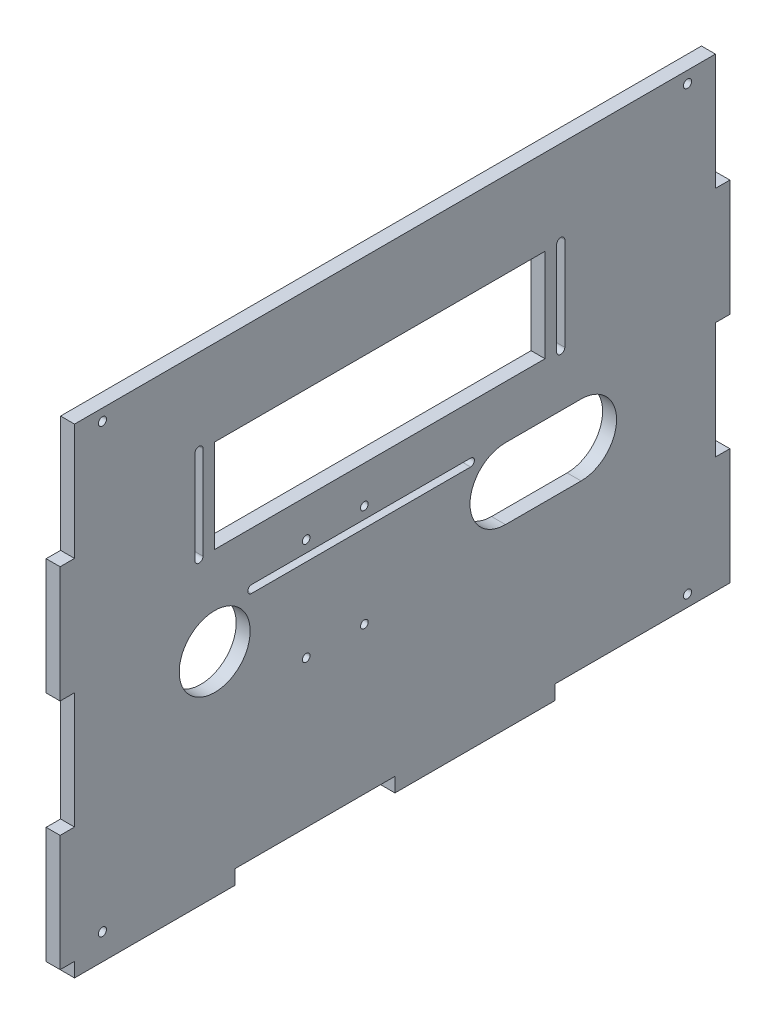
ISO-10303-21;
HEADER;
FILE_DESCRIPTION(('STEP AP214'),'2;1');
FILE_NAME('part.step','',(''),(''),'','','');
FILE_SCHEMA(('AUTOMOTIVE_DESIGN { 1 0 10303 214 1 1 1 1 }'));
ENDSEC;
DATA;
#1=APPLICATION_CONTEXT('core data for automotive mechanical design processes');
#2=APPLICATION_PROTOCOL_DEFINITION('international standard','automotive_design',2000,#1);
#3=PRODUCT_CONTEXT('',#1,'mechanical');
#4=PRODUCT('Part','Part','',(#3));
#5=PRODUCT_RELATED_PRODUCT_CATEGORY('part','',(#4));
#6=PRODUCT_DEFINITION_FORMATION('','',#4);
#7=PRODUCT_DEFINITION_CONTEXT('part definition',#1,'design');
#8=PRODUCT_DEFINITION('design','',#6,#7);
#9=PRODUCT_DEFINITION_SHAPE('','',#8);
#10=(LENGTH_UNIT() NAMED_UNIT(*) SI_UNIT(.MILLI.,.METRE.));
#11=(NAMED_UNIT(*) PLANE_ANGLE_UNIT() SI_UNIT($,.RADIAN.));
#12=(NAMED_UNIT(*) SI_UNIT($,.STERADIAN.) SOLID_ANGLE_UNIT());
#13=UNCERTAINTY_MEASURE_WITH_UNIT(LENGTH_MEASURE(1.E-05),#10,'distance_accuracy_value','');
#14=(GEOMETRIC_REPRESENTATION_CONTEXT(3) GLOBAL_UNCERTAINTY_ASSIGNED_CONTEXT((#13)) GLOBAL_UNIT_ASSIGNED_CONTEXT((#10,
#11,#12)) REPRESENTATION_CONTEXT('',''));
#15=CARTESIAN_POINT('',(0.,0.,0.));
#16=DIRECTION('',(0.,0.,1.));
#17=DIRECTION('',(1.,0.,0.));
#18=AXIS2_PLACEMENT_3D('',#15,#16,#17);
#19=CARTESIAN_POINT('',(6.,-85.2098005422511,-150.75));
#20=DIRECTION('',(0.,0.,1.));
#21=DIRECTION('',(0.,-1.,0.));
#22=AXIS2_PLACEMENT_3D('',#19,#20,#21);
#23=PLANE('',#22);
#24=DIRECTION('',(-1.,0.,0.));
#25=VECTOR('',#24,1.);
#26=CARTESIAN_POINT('',(6.,-35.2098005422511,-150.75));
#27=LINE('',#26,#25);
#28=CARTESIAN_POINT('',(6.,-35.2098005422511,-150.75));
#29=VERTEX_POINT('',#28);
#30=CARTESIAN_POINT('',(0.,-35.2098005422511,-150.75));
#31=VERTEX_POINT('',#30);
#32=EDGE_CURVE('E830',#29,#31,#27,.T.);
#33=ORIENTED_EDGE('',*,*,#32,.T.);
#34=DIRECTION('',(0.,1.,0.));
#35=VECTOR('',#34,1.);
#36=CARTESIAN_POINT('',(0.,-85.2098005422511,-150.75));
#37=LINE('',#36,#35);
#38=CARTESIAN_POINT('',(0.,14.7901994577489,-150.75));
#39=VERTEX_POINT('',#38);
#40=EDGE_CURVE('E655',#31,#39,#37,.T.);
#41=ORIENTED_EDGE('',*,*,#40,.T.);
#42=DIRECTION('',(-1.,0.,0.));
#43=VECTOR('',#42,1.);
#44=CARTESIAN_POINT('',(6.,14.7901994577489,-150.75));
#45=LINE('',#44,#43);
#46=CARTESIAN_POINT('',(6.,14.7901994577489,-150.75));
#47=VERTEX_POINT('',#46);
#48=EDGE_CURVE('E62',#47,#39,#45,.T.);
#49=ORIENTED_EDGE('',*,*,#48,.F.);
#50=DIRECTION('',(0.,1.,0.));
#51=VECTOR('',#50,1.);
#52=CARTESIAN_POINT('',(6.,-85.2098005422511,-150.75));
#53=LINE('',#52,#51);
#54=EDGE_CURVE('E639',#29,#47,#53,.T.);
#55=ORIENTED_EDGE('',*,*,#54,.F.);
#56=EDGE_LOOP('',(#33,#41,#49,#55));
#57=FACE_BOUND('',#56,.T.);
#58=ADVANCED_FACE('F47',(#57),#23,.F.);
#59=DIRECTION('',(-1.,0.,0.));
#60=VECTOR('',#59,1.);
#61=CARTESIAN_POINT('',(6.,64.7901994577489,-150.750000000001));
#62=LINE('',#61,#60);
#63=CARTESIAN_POINT('',(6.,64.7901994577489,-150.750000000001));
#64=VERTEX_POINT('',#63);
#65=CARTESIAN_POINT('',(0.,64.7901994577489,-150.75));
#66=VERTEX_POINT('',#65);
#67=EDGE_CURVE('E70',#64,#66,#62,.T.);
#68=ORIENTED_EDGE('',*,*,#67,.T.);
#69=CARTESIAN_POINT('',(0.,114.790199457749,-150.75));
#70=VERTEX_POINT('',#69);
#71=EDGE_CURVE('E635',#66,#70,#37,.T.);
#72=ORIENTED_EDGE('',*,*,#71,.T.);
#73=DIRECTION('',(-1.,0.,0.));
#74=VECTOR('',#73,1.);
#75=CARTESIAN_POINT('',(6.,114.790199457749,-150.75));
#76=LINE('',#75,#74);
#77=CARTESIAN_POINT('',(6.,114.790199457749,-150.75));
#78=VERTEX_POINT('',#77);
#79=EDGE_CURVE('E11',#78,#70,#76,.T.);
#80=ORIENTED_EDGE('',*,*,#79,.F.);
#81=EDGE_CURVE('E636',#64,#78,#53,.T.);
#82=ORIENTED_EDGE('',*,*,#81,.F.);
#83=EDGE_LOOP('',(#68,#72,#80,#82));
#84=FACE_BOUND('',#83,.T.);
#85=ADVANCED_FACE('F875',(#84),#23,.F.);
#86=CARTESIAN_POINT('',(6.,-85.2098005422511,124.75));
#87=DIRECTION('',(0.,0.,-1.));
#88=DIRECTION('',(0.,1.,0.));
#89=AXIS2_PLACEMENT_3D('',#86,#87,#88);
#90=PLANE('',#89);
#91=DIRECTION('',(-1.,0.,0.));
#92=VECTOR('',#91,1.);
#93=CARTESIAN_POINT('',(6.,64.7901994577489,124.750000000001));
#94=LINE('',#93,#92);
#95=CARTESIAN_POINT('',(6.,64.7901994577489,124.75));
#96=VERTEX_POINT('',#95);
#97=CARTESIAN_POINT('',(0.,64.7901994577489,124.75));
#98=VERTEX_POINT('',#97);
#99=EDGE_CURVE('E814',#96,#98,#94,.T.);
#100=ORIENTED_EDGE('',*,*,#99,.F.);
#101=DIRECTION('',(0.,-1.,0.));
#102=VECTOR('',#101,1.);
#103=CARTESIAN_POINT('',(6.,-85.2098005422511,124.75));
#104=LINE('',#103,#102);
#105=CARTESIAN_POINT('',(6.,114.790199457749,124.75));
#106=VERTEX_POINT('',#105);
#107=EDGE_CURVE('E645',#106,#96,#104,.T.);
#108=ORIENTED_EDGE('',*,*,#107,.F.);
#109=DIRECTION('',(-1.,0.,0.));
#110=VECTOR('',#109,1.);
#111=CARTESIAN_POINT('',(6.,114.790199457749,124.75));
#112=LINE('',#111,#110);
#113=CARTESIAN_POINT('',(0.,114.790199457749,124.75));
#114=VERTEX_POINT('',#113);
#115=EDGE_CURVE('E55',#106,#114,#112,.T.);
#116=ORIENTED_EDGE('',*,*,#115,.T.);
#117=DIRECTION('',(0.,-1.,0.));
#118=VECTOR('',#117,1.);
#119=CARTESIAN_POINT('',(0.,-85.2098005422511,124.75));
#120=LINE('',#119,#118);
#121=EDGE_CURVE('E660',#114,#98,#120,.T.);
#122=ORIENTED_EDGE('',*,*,#121,.T.);
#123=EDGE_LOOP('',(#100,#108,#116,#122));
#124=FACE_BOUND('',#123,.T.);
#125=ADVANCED_FACE('F880',(#124),#90,.F.);
#126=DIRECTION('',(-1.,0.,0.));
#127=VECTOR('',#126,1.);
#128=CARTESIAN_POINT('',(6.,14.7901994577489,124.75));
#129=LINE('',#128,#127);
#130=CARTESIAN_POINT('',(6.,14.7901994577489,124.75));
#131=VERTEX_POINT('',#130);
#132=CARTESIAN_POINT('',(0.,14.7901994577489,124.75));
#133=VERTEX_POINT('',#132);
#134=EDGE_CURVE('E803',#131,#133,#129,.T.);
#135=ORIENTED_EDGE('',*,*,#134,.T.);
#136=CARTESIAN_POINT('',(0.,-35.2098005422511,124.75));
#137=VERTEX_POINT('',#136);
#138=EDGE_CURVE('E659',#133,#137,#120,.T.);
#139=ORIENTED_EDGE('',*,*,#138,.T.);
#140=DIRECTION('',(-1.,0.,0.));
#141=VECTOR('',#140,1.);
#142=CARTESIAN_POINT('',(6.,-35.2098005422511,124.75));
#143=LINE('',#142,#141);
#144=CARTESIAN_POINT('',(6.,-35.2098005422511,124.75));
#145=VERTEX_POINT('',#144);
#146=EDGE_CURVE('E799',#145,#137,#143,.T.);
#147=ORIENTED_EDGE('',*,*,#146,.F.);
#148=EDGE_CURVE('E644',#131,#145,#104,.T.);
#149=ORIENTED_EDGE('',*,*,#148,.F.);
#150=EDGE_LOOP('',(#135,#139,#147,#149));
#151=FACE_BOUND('',#150,.T.);
#152=ADVANCED_FACE('F914',(#151),#90,.F.);
#153=CARTESIAN_POINT('',(6.,-85.2098005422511,124.75));
#154=DIRECTION('',(0.,1.,0.));
#155=DIRECTION('',(0.,0.,1.));
#156=AXIS2_PLACEMENT_3D('',#153,#154,#155);
#157=PLANE('',#156);
#158=DIRECTION('',(-1.,0.,0.));
#159=VECTOR('',#158,1.);
#160=CARTESIAN_POINT('',(6.,-85.2098005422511,55.875));
#161=LINE('',#160,#159);
#162=CARTESIAN_POINT('',(6.,-85.2098005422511,55.875));
#163=VERTEX_POINT('',#162);
#164=CARTESIAN_POINT('',(0.,-85.2098005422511,55.875));
#165=VERTEX_POINT('',#164);
#166=EDGE_CURVE('E365',#163,#165,#161,.T.);
#167=ORIENTED_EDGE('',*,*,#166,.T.);
#168=DIRECTION('',(0.,0.,-1.));
#169=VECTOR('',#168,1.);
#170=CARTESIAN_POINT('',(0.,-85.2098005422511,124.75));
#171=LINE('',#170,#169);
#172=CARTESIAN_POINT('',(0.,-85.2098005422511,-13.));
#173=VERTEX_POINT('',#172);
#174=EDGE_CURVE('E640',#165,#173,#171,.T.);
#175=ORIENTED_EDGE('',*,*,#174,.T.);
#176=DIRECTION('',(-1.,0.,0.));
#177=VECTOR('',#176,1.);
#178=CARTESIAN_POINT('',(6.,-85.2098005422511,-13.));
#179=LINE('',#178,#177);
#180=CARTESIAN_POINT('',(6.,-85.2098005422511,-13.));
#181=VERTEX_POINT('',#180);
#182=EDGE_CURVE('E681',#181,#173,#179,.T.);
#183=ORIENTED_EDGE('',*,*,#182,.F.);
#184=DIRECTION('',(0.,0.,-1.));
#185=VECTOR('',#184,1.);
#186=CARTESIAN_POINT('',(6.,-85.2098005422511,124.75));
#187=LINE('',#186,#185);
#188=EDGE_CURVE('E652',#163,#181,#187,.T.);
#189=ORIENTED_EDGE('',*,*,#188,.F.);
#190=EDGE_LOOP('',(#167,#175,#183,#189));
#191=FACE_BOUND('',#190,.T.);
#192=ADVANCED_FACE('F853',(#191),#157,.F.);
#193=DIRECTION('',(-1.,0.,0.));
#194=VECTOR('',#193,1.);
#195=CARTESIAN_POINT('',(6.,-85.2098005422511,-81.875));
#196=LINE('',#195,#194);
#197=CARTESIAN_POINT('',(6.,-85.2098005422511,-81.875));
#198=VERTEX_POINT('',#197);
#199=CARTESIAN_POINT('',(0.,-85.2098005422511,-81.875));
#200=VERTEX_POINT('',#199);
#201=EDGE_CURVE('E841',#198,#200,#196,.T.);
#202=ORIENTED_EDGE('',*,*,#201,.T.);
#203=CARTESIAN_POINT('',(0.,-85.2098005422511,-156.95));
#204=VERTEX_POINT('',#203);
#205=EDGE_CURVE('E663',#200,#204,#171,.T.);
#206=ORIENTED_EDGE('',*,*,#205,.T.);
#207=DIRECTION('',(-1.,0.,0.));
#208=VECTOR('',#207,1.);
#209=CARTESIAN_POINT('',(6.,-85.2098005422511,-156.95));
#210=LINE('',#209,#208);
#211=CARTESIAN_POINT('',(6.,-85.2098005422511,-156.95));
#212=VERTEX_POINT('',#211);
#213=EDGE_CURVE('E837',#212,#204,#210,.T.);
#214=ORIENTED_EDGE('',*,*,#213,.F.);
#215=EDGE_CURVE('E649',#198,#212,#187,.T.);
#216=ORIENTED_EDGE('',*,*,#215,.F.);
#217=EDGE_LOOP('',(#202,#206,#214,#216));
#218=FACE_BOUND('',#217,.T.);
#219=ADVANCED_FACE('F905',(#218),#157,.F.);
#220=CARTESIAN_POINT('',(6.,0.,0.));
#221=DIRECTION('',(-1.,0.,0.));
#222=DIRECTION('',(0.,0.,1.));
#223=AXIS2_PLACEMENT_3D('',#220,#221,#222);
#224=PLANE('',#223);
#225=ORIENTED_EDGE('',*,*,#148,.T.);
#226=DIRECTION('',(0.,0.,1.));
#227=VECTOR('',#226,1.);
#228=CARTESIAN_POINT('',(6.,-35.2098005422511,124.75));
#229=LINE('',#228,#227);
#230=CARTESIAN_POINT('',(6.,-35.2098005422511,130.95));
#231=VERTEX_POINT('',#230);
#232=EDGE_CURVE('E725',#145,#231,#229,.T.);
#233=ORIENTED_EDGE('',*,*,#232,.T.);
#234=DIRECTION('',(0.,-1.,0.));
#235=VECTOR('',#234,1.);
#236=CARTESIAN_POINT('',(6.,-85.2098005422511,130.95));
#237=LINE('',#236,#235);
#238=CARTESIAN_POINT('',(6.,-85.2098005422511,130.95));
#239=VERTEX_POINT('',#238);
#240=EDGE_CURVE('E728',#231,#239,#237,.T.);
#241=ORIENTED_EDGE('',*,*,#240,.T.);
#242=DIRECTION('',(0.,0.,-1.));
#243=VECTOR('',#242,1.);
#244=CARTESIAN_POINT('',(6.,-85.2098005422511,124.75));
#245=LINE('',#244,#243);
#246=CARTESIAN_POINT('',(6.,-85.2098005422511,124.75));
#247=VERTEX_POINT('',#246);
#248=EDGE_CURVE('E347',#239,#247,#245,.T.);
#249=ORIENTED_EDGE('',*,*,#248,.T.);
#250=DIRECTION('',(0.,-1.,0.));
#251=VECTOR('',#250,1.);
#252=CARTESIAN_POINT('',(6.,-85.2098005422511,124.75));
#253=LINE('',#252,#251);
#254=CARTESIAN_POINT('',(6.,-91.4098005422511,124.75));
#255=VERTEX_POINT('',#254);
#256=EDGE_CURVE('E341',#247,#255,#253,.T.);
#257=ORIENTED_EDGE('',*,*,#256,.T.);
#258=DIRECTION('',(0.,0.,-1.));
#259=VECTOR('',#258,1.);
#260=CARTESIAN_POINT('',(6.,-91.4098005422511,124.75));
#261=LINE('',#260,#259);
#262=CARTESIAN_POINT('',(6.,-91.4098005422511,55.875));
#263=VERTEX_POINT('',#262);
#264=EDGE_CURVE('E328',#255,#263,#261,.T.);
#265=ORIENTED_EDGE('',*,*,#264,.T.);
#266=DIRECTION('',(0.,1.,0.));
#267=VECTOR('',#266,1.);
#268=CARTESIAN_POINT('',(6.,-85.2098005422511,55.875));
#269=LINE('',#268,#267);
#270=EDGE_CURVE('E340',#263,#163,#269,.T.);
#271=ORIENTED_EDGE('',*,*,#270,.T.);
#272=ORIENTED_EDGE('',*,*,#188,.T.);
#273=DIRECTION('',(0.,-1.,0.));
#274=VECTOR('',#273,1.);
#275=CARTESIAN_POINT('',(6.,-85.2098005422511,-13.));
#276=LINE('',#275,#274);
#277=CARTESIAN_POINT('',(6.,-91.4098005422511,-13.));
#278=VERTEX_POINT('',#277);
#279=EDGE_CURVE('E674',#181,#278,#276,.T.);
#280=ORIENTED_EDGE('',*,*,#279,.T.);
#281=DIRECTION('',(0.,0.,-1.));
#282=VECTOR('',#281,1.);
#283=CARTESIAN_POINT('',(6.,-91.4098005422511,-13.));
#284=LINE('',#283,#282);
#285=CARTESIAN_POINT('',(6.,-91.4098005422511,-81.875));
#286=VERTEX_POINT('',#285);
#287=EDGE_CURVE('E687',#278,#286,#284,.T.);
#288=ORIENTED_EDGE('',*,*,#287,.T.);
#289=DIRECTION('',(0.,1.,0.));
#290=VECTOR('',#289,1.);
#291=CARTESIAN_POINT('',(6.,-85.2098005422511,-81.875));
#292=LINE('',#291,#290);
#293=EDGE_CURVE('E691',#286,#198,#292,.T.);
#294=ORIENTED_EDGE('',*,*,#293,.T.);
#295=ORIENTED_EDGE('',*,*,#215,.T.);
#296=DIRECTION('',(0.,1.,0.));
#297=VECTOR('',#296,1.);
#298=CARTESIAN_POINT('',(6.,-85.2098005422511,-156.95));
#299=LINE('',#298,#297);
#300=CARTESIAN_POINT('',(6.,-35.2098005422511,-156.95));
#301=VERTEX_POINT('',#300);
#302=EDGE_CURVE('E698',#212,#301,#299,.T.);
#303=ORIENTED_EDGE('',*,*,#302,.T.);
#304=DIRECTION('',(0.,0.,1.));
#305=VECTOR('',#304,1.);
#306=CARTESIAN_POINT('',(6.,-35.2098005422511,-150.75));
#307=LINE('',#306,#305);
#308=EDGE_CURVE('E701',#301,#29,#307,.T.);
#309=ORIENTED_EDGE('',*,*,#308,.T.);
#310=ORIENTED_EDGE('',*,*,#54,.T.);
#311=DIRECTION('',(0.,0.,-1.));
#312=VECTOR('',#311,1.);
#313=CARTESIAN_POINT('',(6.,14.7901994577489,-150.75));
#314=LINE('',#313,#312);
#315=CARTESIAN_POINT('',(6.,14.7901994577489,-156.95));
#316=VERTEX_POINT('',#315);
#317=EDGE_CURVE('E705',#47,#316,#314,.T.);
#318=ORIENTED_EDGE('',*,*,#317,.T.);
#319=DIRECTION('',(0.,1.,0.));
#320=VECTOR('',#319,1.);
#321=CARTESIAN_POINT('',(6.,14.7901994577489,-156.95));
#322=LINE('',#321,#320);
#323=CARTESIAN_POINT('',(6.,64.7901994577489,-156.950000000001));
#324=VERTEX_POINT('',#323);
#325=EDGE_CURVE('E708',#316,#324,#322,.T.);
#326=ORIENTED_EDGE('',*,*,#325,.T.);
#327=DIRECTION('',(0.,0.,1.));
#328=VECTOR('',#327,1.);
#329=CARTESIAN_POINT('',(6.,64.7901994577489,-150.750000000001));
#330=LINE('',#329,#328);
#331=EDGE_CURVE('E711',#324,#64,#330,.T.);
#332=ORIENTED_EDGE('',*,*,#331,.T.);
#333=ORIENTED_EDGE('',*,*,#81,.T.);
#334=DIRECTION('',(0.,0.,1.));
#335=VECTOR('',#334,1.);
#336=CARTESIAN_POINT('',(6.,114.790199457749,124.75));
#337=LINE('',#336,#335);
#338=EDGE_CURVE('E641',#78,#106,#337,.T.);
#339=ORIENTED_EDGE('',*,*,#338,.T.);
#340=ORIENTED_EDGE('',*,*,#107,.T.);
#341=DIRECTION('',(0.,0.,1.));
#342=VECTOR('',#341,1.);
#343=CARTESIAN_POINT('',(6.,64.7901994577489,124.750000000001));
#344=LINE('',#343,#342);
#345=CARTESIAN_POINT('',(6.,64.7901994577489,130.950000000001));
#346=VERTEX_POINT('',#345);
#347=EDGE_CURVE('E715',#96,#346,#344,.T.);
#348=ORIENTED_EDGE('',*,*,#347,.T.);
#349=DIRECTION('',(0.,-1.,0.));
#350=VECTOR('',#349,1.);
#351=CARTESIAN_POINT('',(6.,14.7901994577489,130.95));
#352=LINE('',#351,#350);
#353=CARTESIAN_POINT('',(6.,14.7901994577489,130.95));
#354=VERTEX_POINT('',#353);
#355=EDGE_CURVE('E718',#346,#354,#352,.T.);
#356=ORIENTED_EDGE('',*,*,#355,.T.);
#357=DIRECTION('',(0.,0.,-1.));
#358=VECTOR('',#357,1.);
#359=CARTESIAN_POINT('',(6.,14.7901994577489,124.75));
#360=LINE('',#359,#358);
#361=EDGE_CURVE('E721',#354,#131,#360,.T.);
#362=ORIENTED_EDGE('',*,*,#361,.T.);
#363=EDGE_LOOP('',(#225,#233,#241,#249,#257,#265,#271,#272,#280,#288,#294,#295,#303,#309,#310,
#318,#326,#332,#333,#339,#340,#348,#356,#362));
#364=FACE_BOUND('',#363,.T.);
#365=CARTESIAN_POINT('',(6.,-80.2098005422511,112.75));
#366=DIRECTION('',(1.,0.,0.));
#367=DIRECTION('',(0.,0.,-1.));
#368=AXIS2_PLACEMENT_3D('',#365,#366,#367);
#369=CIRCLE('',#368,1.75000000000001);
#370=CARTESIAN_POINT('',(6.,-80.2098005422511,111.));
#371=VERTEX_POINT('',#370);
#372=EDGE_CURVE('E424',#371,#371,#369,.T.);
#373=ORIENTED_EDGE('',*,*,#372,.F.);
#374=EDGE_LOOP('',(#373));
#375=FACE_BOUND('',#374,.T.);
#376=CARTESIAN_POINT('',(6.,-80.2098005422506,-138.75));
#377=DIRECTION('',(1.,0.,0.));
#378=DIRECTION('',(0.,0.,1.));
#379=AXIS2_PLACEMENT_3D('',#376,#377,#378);
#380=CIRCLE('',#379,1.75000000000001);
#381=CARTESIAN_POINT('',(6.,-80.2098005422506,-137.));
#382=VERTEX_POINT('',#381);
#383=EDGE_CURVE('E432',#382,#382,#380,.T.);
#384=ORIENTED_EDGE('',*,*,#383,.F.);
#385=EDGE_LOOP('',(#384));
#386=FACE_BOUND('',#385,.T.);
#387=CARTESIAN_POINT('',(6.,109.790199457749,112.75));
#388=DIRECTION('',(1.,0.,0.));
#389=DIRECTION('',(0.,0.,1.));
#390=AXIS2_PLACEMENT_3D('',#387,#388,#389);
#391=CIRCLE('',#390,1.75000000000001);
#392=CARTESIAN_POINT('',(6.,109.790199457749,114.5));
#393=VERTEX_POINT('',#392);
#394=EDGE_CURVE('E440',#393,#393,#391,.T.);
#395=ORIENTED_EDGE('',*,*,#394,.F.);
#396=EDGE_LOOP('',(#395));
#397=FACE_BOUND('',#396,.T.);
#398=CARTESIAN_POINT('',(6.,109.790199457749,-138.75));
#399=DIRECTION('',(1.,0.,0.));
#400=DIRECTION('',(0.,0.,-1.));
#401=AXIS2_PLACEMENT_3D('',#398,#399,#400);
#402=CIRCLE('',#401,1.75000000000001);
#403=CARTESIAN_POINT('',(6.,109.790199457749,-140.5));
#404=VERTEX_POINT('',#403);
#405=EDGE_CURVE('E448',#404,#404,#402,.T.);
#406=ORIENTED_EDGE('',*,*,#405,.F.);
#407=EDGE_LOOP('',(#406));
#408=FACE_BOUND('',#407,.T.);
#409=CARTESIAN_POINT('',(6.,78.,-84.2499999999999));
#410=DIRECTION('',(1.,0.,0.));
#411=DIRECTION('',(0.,0.,-1.));
#412=AXIS2_PLACEMENT_3D('',#409,#410,#411);
#413=CIRCLE('',#412,1.74999999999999);
#414=CARTESIAN_POINT('',(6.,78.,-86.));
#415=VERTEX_POINT('',#414);
#416=CARTESIAN_POINT('',(6.,78.,-82.5));
#417=VERTEX_POINT('',#416);
#418=EDGE_CURVE('E456',#415,#417,#413,.T.);
#419=ORIENTED_EDGE('',*,*,#418,.F.);
#420=DIRECTION('',(0.,1.,0.));
#421=VECTOR('',#420,1.);
#422=CARTESIAN_POINT('',(6.,78.,-86.));
#423=LINE('',#422,#421);
#424=CARTESIAN_POINT('',(6.,38.,-86.));
#425=VERTEX_POINT('',#424);
#426=EDGE_CURVE('E467',#425,#415,#423,.T.);
#427=ORIENTED_EDGE('',*,*,#426,.F.);
#428=CARTESIAN_POINT('',(6.,38.,-84.25));
#429=DIRECTION('',(1.,0.,0.));
#430=DIRECTION('',(0.,0.,-1.));
#431=AXIS2_PLACEMENT_3D('',#428,#429,#430);
#432=CIRCLE('',#431,1.74999999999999);
#433=CARTESIAN_POINT('',(6.,38.,-82.5));
#434=VERTEX_POINT('',#433);
#435=EDGE_CURVE('E463',#434,#425,#432,.T.);
#436=ORIENTED_EDGE('',*,*,#435,.F.);
#437=DIRECTION('',(0.,-1.,0.));
#438=VECTOR('',#437,1.);
#439=CARTESIAN_POINT('',(6.,78.,-82.5));
#440=LINE('',#439,#438);
#441=EDGE_CURVE('E459',#417,#434,#440,.T.);
#442=ORIENTED_EDGE('',*,*,#441,.F.);
#443=EDGE_LOOP('',(#419,#427,#436,#442));
#444=FACE_BOUND('',#443,.T.);
#445=DIRECTION('',(0.,-1.,0.));
#446=VECTOR('',#445,1.);
#447=CARTESIAN_POINT('',(6.,38.,64.5));
#448=LINE('',#447,#446);
#449=CARTESIAN_POINT('',(6.,78.,64.5));
#450=VERTEX_POINT('',#449);
#451=CARTESIAN_POINT('',(6.,38.,64.5));
#452=VERTEX_POINT('',#451);
#453=EDGE_CURVE('E550',#450,#452,#448,.T.);
#454=ORIENTED_EDGE('',*,*,#453,.F.);
#455=DIRECTION('',(0.,0.,1.));
#456=VECTOR('',#455,1.);
#457=CARTESIAN_POINT('',(6.,78.,64.5));
#458=LINE('',#457,#456);
#459=CARTESIAN_POINT('',(6.,78.,-77.5));
#460=VERTEX_POINT('',#459);
#461=EDGE_CURVE('E561',#460,#450,#458,.T.);
#462=ORIENTED_EDGE('',*,*,#461,.F.);
#463=DIRECTION('',(0.,1.,0.));
#464=VECTOR('',#463,1.);
#465=CARTESIAN_POINT('',(6.,38.,-77.5));
#466=LINE('',#465,#464);
#467=CARTESIAN_POINT('',(6.,38.,-77.5));
#468=VERTEX_POINT('',#467);
#469=EDGE_CURVE('E557',#468,#460,#466,.T.);
#470=ORIENTED_EDGE('',*,*,#469,.F.);
#471=DIRECTION('',(0.,0.,-1.));
#472=VECTOR('',#471,1.);
#473=CARTESIAN_POINT('',(6.,38.,64.5));
#474=LINE('',#473,#472);
#475=EDGE_CURVE('E553',#452,#468,#474,.T.);
#476=ORIENTED_EDGE('',*,*,#475,.F.);
#477=EDGE_LOOP('',(#454,#462,#470,#476));
#478=FACE_BOUND('',#477,.T.);
#479=CARTESIAN_POINT('',(6.,0.,-93.));
#480=DIRECTION('',(1.,0.,0.));
#481=DIRECTION('',(0.,0.,-1.));
#482=AXIS2_PLACEMENT_3D('',#479,#480,#481);
#483=CIRCLE('',#482,15.25);
#484=CARTESIAN_POINT('',(6.,-15.25,-93.));
#485=VERTEX_POINT('',#484);
#486=CARTESIAN_POINT('',(6.,15.25,-93.));
#487=VERTEX_POINT('',#486);
#488=EDGE_CURVE('E593',#485,#487,#483,.T.);
#489=ORIENTED_EDGE('',*,*,#488,.F.);
#490=DIRECTION('',(0.,0.,-1.));
#491=VECTOR('',#490,1.);
#492=CARTESIAN_POINT('',(6.,-15.25,-93.));
#493=LINE('',#492,#491);
#494=CARTESIAN_POINT('',(6.,-15.25,-60.5));
#495=VERTEX_POINT('',#494);
#496=EDGE_CURVE('E604',#495,#485,#493,.T.);
#497=ORIENTED_EDGE('',*,*,#496,.F.);
#498=CARTESIAN_POINT('',(6.,0.,-60.5));
#499=DIRECTION('',(1.,0.,0.));
#500=DIRECTION('',(0.,0.,1.));
#501=AXIS2_PLACEMENT_3D('',#498,#499,#500);
#502=CIRCLE('',#501,15.25);
#503=CARTESIAN_POINT('',(6.,15.25,-60.5));
#504=VERTEX_POINT('',#503);
#505=EDGE_CURVE('E600',#504,#495,#502,.T.);
#506=ORIENTED_EDGE('',*,*,#505,.F.);
#507=DIRECTION('',(0.,0.,1.));
#508=VECTOR('',#507,1.);
#509=CARTESIAN_POINT('',(6.,15.25,-93.));
#510=LINE('',#509,#508);
#511=EDGE_CURVE('E596',#487,#504,#510,.T.);
#512=ORIENTED_EDGE('',*,*,#511,.F.);
#513=EDGE_LOOP('',(#489,#497,#506,#512));
#514=FACE_BOUND('',#513,.T.);
#515=CARTESIAN_POINT('',(6.,78.,71.25));
#516=DIRECTION('',(1.,0.,0.));
#517=DIRECTION('',(0.,0.,-1.));
#518=AXIS2_PLACEMENT_3D('',#515,#516,#517);
#519=CIRCLE('',#518,1.74999999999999);
#520=CARTESIAN_POINT('',(6.,78.,69.5));
#521=VERTEX_POINT('',#520);
#522=CARTESIAN_POINT('',(6.,78.,73.));
#523=VERTEX_POINT('',#522);
#524=EDGE_CURVE('E499',#521,#523,#519,.T.);
#525=ORIENTED_EDGE('',*,*,#524,.F.);
#526=DIRECTION('',(0.,1.,0.));
#527=VECTOR('',#526,1.);
#528=CARTESIAN_POINT('',(6.,78.,69.5));
#529=LINE('',#528,#527);
#530=CARTESIAN_POINT('',(6.,38.,69.5));
#531=VERTEX_POINT('',#530);
#532=EDGE_CURVE('E510',#531,#521,#529,.T.);
#533=ORIENTED_EDGE('',*,*,#532,.F.);
#534=CARTESIAN_POINT('',(6.,38.,71.25));
#535=DIRECTION('',(1.,0.,0.));
#536=DIRECTION('',(0.,0.,-1.));
#537=AXIS2_PLACEMENT_3D('',#534,#535,#536);
#538=CIRCLE('',#537,1.74999999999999);
#539=CARTESIAN_POINT('',(6.,38.,73.));
#540=VERTEX_POINT('',#539);
#541=EDGE_CURVE('E506',#540,#531,#538,.T.);
#542=ORIENTED_EDGE('',*,*,#541,.F.);
#543=DIRECTION('',(0.,-1.,0.));
#544=VECTOR('',#543,1.);
#545=CARTESIAN_POINT('',(6.,78.,73.));
#546=LINE('',#545,#544);
#547=EDGE_CURVE('E502',#523,#540,#546,.T.);
#548=ORIENTED_EDGE('',*,*,#547,.F.);
#549=EDGE_LOOP('',(#525,#533,#542,#548));
#550=FACE_BOUND('',#549,.T.);
#551=CARTESIAN_POINT('',(6.,15.35,48.6148293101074));
#552=DIRECTION('',(1.,0.,0.));
#553=DIRECTION('',(0.,0.,-1.));
#554=AXIS2_PLACEMENT_3D('',#551,#552,#553);
#555=CIRCLE('',#554,1.65);
#556=CARTESIAN_POINT('',(6.,17.,48.6148293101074));
#557=VERTEX_POINT('',#556);
#558=CARTESIAN_POINT('',(6.,13.7,48.6148293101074));
#559=VERTEX_POINT('',#558);
#560=EDGE_CURVE('E388',#557,#559,#555,.T.);
#561=ORIENTED_EDGE('',*,*,#560,.F.);
#562=DIRECTION('',(0.,0.,1.));
#563=VECTOR('',#562,1.);
#564=CARTESIAN_POINT('',(6.,17.,-45.5));
#565=LINE('',#564,#563);
#566=CARTESIAN_POINT('',(6.,17.,-45.5));
#567=VERTEX_POINT('',#566);
#568=EDGE_CURVE('E384',#567,#557,#565,.T.);
#569=ORIENTED_EDGE('',*,*,#568,.F.);
#570=CARTESIAN_POINT('',(6.,15.35,-45.5));
#571=DIRECTION('',(1.,0.,0.));
#572=DIRECTION('',(0.,0.,-1.));
#573=AXIS2_PLACEMENT_3D('',#570,#571,#572);
#574=CIRCLE('',#573,1.65);
#575=CARTESIAN_POINT('',(6.,13.7,-45.5));
#576=VERTEX_POINT('',#575);
#577=EDGE_CURVE('E381',#576,#567,#574,.T.);
#578=ORIENTED_EDGE('',*,*,#577,.F.);
#579=DIRECTION('',(0.,0.,-1.));
#580=VECTOR('',#579,1.);
#581=CARTESIAN_POINT('',(6.,13.7,-45.5));
#582=LINE('',#581,#580);
#583=EDGE_CURVE('E392',#559,#576,#582,.T.);
#584=ORIENTED_EDGE('',*,*,#583,.F.);
#585=EDGE_LOOP('',(#561,#569,#578,#584));
#586=FACE_BOUND('',#585,.T.);
#587=CARTESIAN_POINT('',(6.,0.,64.5));
#588=DIRECTION('',(1.,0.,0.));
#589=DIRECTION('',(0.,0.,-1.));
#590=AXIS2_PLACEMENT_3D('',#587,#588,#589);
#591=CIRCLE('',#590,15.25);
#592=CARTESIAN_POINT('',(6.,0.,49.25));
#593=VERTEX_POINT('',#592);
#594=EDGE_CURVE('E542',#593,#593,#591,.T.);
#595=ORIENTED_EDGE('',*,*,#594,.F.);
#596=EDGE_LOOP('',(#595));
#597=FACE_BOUND('',#596,.T.);
#598=CARTESIAN_POINT('',(6.,22.,0.160287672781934));
#599=DIRECTION('',(-1.,0.,0.));
#600=DIRECTION('',(0.,-1.,0.));
#601=AXIS2_PLACEMENT_3D('',#598,#599,#600);
#602=CIRCLE('',#601,1.6499999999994);
#603=CARTESIAN_POINT('',(6.,20.3500000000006,0.160287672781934));
#604=VERTEX_POINT('',#603);
#605=EDGE_CURVE('E737',#604,#604,#602,.F.);
#606=ORIENTED_EDGE('',*,*,#605,.F.);
#607=EDGE_LOOP('',(#606));
#608=FACE_BOUND('',#607,.T.);
#609=CARTESIAN_POINT('',(6.,-22.,0.160287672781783));
#610=DIRECTION('',(-1.,0.,0.));
#611=DIRECTION('',(0.,-1.,0.));
#612=AXIS2_PLACEMENT_3D('',#609,#610,#611);
#613=CIRCLE('',#612,1.6499999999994);
#614=CARTESIAN_POINT('',(6.,-23.6499999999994,0.160287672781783));
#615=VERTEX_POINT('',#614);
#616=EDGE_CURVE('E1147',#615,#615,#613,.F.);
#617=ORIENTED_EDGE('',*,*,#616,.F.);
#618=EDGE_LOOP('',(#617));
#619=FACE_BOUND('',#618,.T.);
#620=CARTESIAN_POINT('',(6.,21.9999999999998,25.1602876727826));
#621=DIRECTION('',(-1.,0.,0.));
#622=DIRECTION('',(0.,-1.,0.));
#623=AXIS2_PLACEMENT_3D('',#620,#621,#622);
#624=CIRCLE('',#623,1.65);
#625=CARTESIAN_POINT('',(6.,20.3499999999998,25.1602876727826));
#626=VERTEX_POINT('',#625);
#627=EDGE_CURVE('E1151',#626,#626,#624,.F.);
#628=ORIENTED_EDGE('',*,*,#627,.F.);
#629=EDGE_LOOP('',(#628));
#630=FACE_BOUND('',#629,.T.);
#631=CARTESIAN_POINT('',(6.,-22.0000000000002,25.1602876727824));
#632=DIRECTION('',(-1.,0.,0.));
#633=DIRECTION('',(0.,-1.,0.));
#634=AXIS2_PLACEMENT_3D('',#631,#632,#633);
#635=CIRCLE('',#634,1.65);
#636=CARTESIAN_POINT('',(6.,-23.6500000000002,25.1602876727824));
#637=VERTEX_POINT('',#636);
#638=EDGE_CURVE('E1154',#637,#637,#635,.F.);
#639=ORIENTED_EDGE('',*,*,#638,.F.);
#640=EDGE_LOOP('',(#639));
#641=FACE_BOUND('',#640,.T.);
#642=ADVANCED_FACE('F344',(#364,#375,#386,#397,#408,#444,#478,#514,#550,#586,#597,#608,#619,
#630,#641),#224,.F.);
#643=CARTESIAN_POINT('',(0.,0.,0.));
#644=DIRECTION('',(-1.,0.,0.));
#645=DIRECTION('',(0.,0.,1.));
#646=AXIS2_PLACEMENT_3D('',#643,#644,#645);
#647=PLANE('',#646);
#648=CARTESIAN_POINT('',(0.,22.,0.160287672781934));
#649=DIRECTION('',(1.,0.,0.));
#650=DIRECTION('',(0.,0.,-1.));
#651=AXIS2_PLACEMENT_3D('',#648,#649,#650);
#652=CIRCLE('',#651,1.6499999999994);
#653=CARTESIAN_POINT('',(0.,22.,-1.48971232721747));
#654=VERTEX_POINT('',#653);
#655=EDGE_CURVE('E358',#654,#654,#652,.T.);
#656=ORIENTED_EDGE('',*,*,#655,.T.);
#657=EDGE_LOOP('',(#656));
#658=FACE_BOUND('',#657,.T.);
#659=CARTESIAN_POINT('',(0.,21.9999999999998,25.1602876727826));
#660=DIRECTION('',(1.,0.,0.));
#661=DIRECTION('',(0.,0.,-1.));
#662=AXIS2_PLACEMENT_3D('',#659,#660,#661);
#663=CIRCLE('',#662,1.65);
#664=CARTESIAN_POINT('',(0.,21.9999999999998,23.5102876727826));
#665=VERTEX_POINT('',#664);
#666=EDGE_CURVE('E363',#665,#665,#663,.T.);
#667=ORIENTED_EDGE('',*,*,#666,.T.);
#668=EDGE_LOOP('',(#667));
#669=FACE_BOUND('',#668,.T.);
#670=CARTESIAN_POINT('',(0.,-22.0000000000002,25.1602876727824));
#671=DIRECTION('',(1.,0.,0.));
#672=DIRECTION('',(0.,0.,-1.));
#673=AXIS2_PLACEMENT_3D('',#670,#671,#672);
#674=CIRCLE('',#673,1.65);
#675=CARTESIAN_POINT('',(0.,-22.0000000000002,23.5102876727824));
#676=VERTEX_POINT('',#675);
#677=EDGE_CURVE('E369',#676,#676,#674,.T.);
#678=ORIENTED_EDGE('',*,*,#677,.T.);
#679=EDGE_LOOP('',(#678));
#680=FACE_BOUND('',#679,.T.);
#681=CARTESIAN_POINT('',(0.,-22.,0.160287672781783));
#682=DIRECTION('',(1.,0.,0.));
#683=DIRECTION('',(0.,0.,-1.));
#684=AXIS2_PLACEMENT_3D('',#681,#682,#683);
#685=CIRCLE('',#684,1.6499999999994);
#686=CARTESIAN_POINT('',(0.,-22.,-1.48971232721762));
#687=VERTEX_POINT('',#686);
#688=EDGE_CURVE('E373',#687,#687,#685,.T.);
#689=ORIENTED_EDGE('',*,*,#688,.T.);
#690=EDGE_LOOP('',(#689));
#691=FACE_BOUND('',#690,.T.);
#692=CARTESIAN_POINT('',(0.,-80.2098005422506,-138.75));
#693=DIRECTION('',(1.,0.,0.));
#694=DIRECTION('',(0.,0.,1.));
#695=AXIS2_PLACEMENT_3D('',#692,#693,#694);
#696=CIRCLE('',#695,1.75000000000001);
#697=CARTESIAN_POINT('',(0.,-80.2098005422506,-137.));
#698=VERTEX_POINT('',#697);
#699=EDGE_CURVE('E428',#698,#698,#696,.T.);
#700=ORIENTED_EDGE('',*,*,#699,.T.);
#701=EDGE_LOOP('',(#700));
#702=FACE_BOUND('',#701,.T.);
#703=CARTESIAN_POINT('',(0.,109.790199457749,-138.75));
#704=DIRECTION('',(1.,0.,0.));
#705=DIRECTION('',(0.,0.,-1.));
#706=AXIS2_PLACEMENT_3D('',#703,#704,#705);
#707=CIRCLE('',#706,1.75000000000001);
#708=CARTESIAN_POINT('',(0.,109.790199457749,-140.5));
#709=VERTEX_POINT('',#708);
#710=EDGE_CURVE('E444',#709,#709,#707,.T.);
#711=ORIENTED_EDGE('',*,*,#710,.T.);
#712=EDGE_LOOP('',(#711));
#713=FACE_BOUND('',#712,.T.);
#714=DIRECTION('',(0.,0.,1.));
#715=VECTOR('',#714,1.);
#716=CARTESIAN_POINT('',(0.,78.,64.5));
#717=LINE('',#716,#715);
#718=CARTESIAN_POINT('',(0.,78.,-77.5));
#719=VERTEX_POINT('',#718);
#720=CARTESIAN_POINT('',(0.,78.,64.5));
#721=VERTEX_POINT('',#720);
#722=EDGE_CURVE('E554',#719,#721,#717,.T.);
#723=ORIENTED_EDGE('',*,*,#722,.T.);
#724=DIRECTION('',(0.,-1.,0.));
#725=VECTOR('',#724,1.);
#726=CARTESIAN_POINT('',(0.,38.,64.5));
#727=LINE('',#726,#725);
#728=CARTESIAN_POINT('',(0.,38.,64.5));
#729=VERTEX_POINT('',#728);
#730=EDGE_CURVE('E546',#721,#729,#727,.T.);
#731=ORIENTED_EDGE('',*,*,#730,.T.);
#732=DIRECTION('',(0.,0.,-1.));
#733=VECTOR('',#732,1.);
#734=CARTESIAN_POINT('',(0.,38.,64.5));
#735=LINE('',#734,#733);
#736=CARTESIAN_POINT('',(0.,38.,-77.5));
#737=VERTEX_POINT('',#736);
#738=EDGE_CURVE('E568',#729,#737,#735,.T.);
#739=ORIENTED_EDGE('',*,*,#738,.T.);
#740=DIRECTION('',(0.,1.,0.));
#741=VECTOR('',#740,1.);
#742=CARTESIAN_POINT('',(0.,38.,-77.5));
#743=LINE('',#742,#741);
#744=EDGE_CURVE('E572',#737,#719,#743,.T.);
#745=ORIENTED_EDGE('',*,*,#744,.T.);
#746=EDGE_LOOP('',(#723,#731,#739,#745));
#747=FACE_BOUND('',#746,.T.);
#748=DIRECTION('',(0.,0.,-1.));
#749=VECTOR('',#748,1.);
#750=CARTESIAN_POINT('',(0.,-15.25,-93.));
#751=LINE('',#750,#749);
#752=CARTESIAN_POINT('',(0.,-15.25,-60.5));
#753=VERTEX_POINT('',#752);
#754=CARTESIAN_POINT('',(0.,-15.25,-93.));
#755=VERTEX_POINT('',#754);
#756=EDGE_CURVE('E597',#753,#755,#751,.T.);
#757=ORIENTED_EDGE('',*,*,#756,.T.);
#758=CARTESIAN_POINT('',(0.,0.,-93.));
#759=DIRECTION('',(1.,0.,0.));
#760=DIRECTION('',(0.,0.,-1.));
#761=AXIS2_PLACEMENT_3D('',#758,#759,#760);
#762=CIRCLE('',#761,15.25);
#763=CARTESIAN_POINT('',(0.,15.25,-93.));
#764=VERTEX_POINT('',#763);
#765=EDGE_CURVE('E592',#755,#764,#762,.T.);
#766=ORIENTED_EDGE('',*,*,#765,.T.);
#767=DIRECTION('',(0.,0.,1.));
#768=VECTOR('',#767,1.);
#769=CARTESIAN_POINT('',(0.,15.25,-93.));
#770=LINE('',#769,#768);
#771=CARTESIAN_POINT('',(0.,15.25,-60.5));
#772=VERTEX_POINT('',#771);
#773=EDGE_CURVE('E611',#764,#772,#770,.T.);
#774=ORIENTED_EDGE('',*,*,#773,.T.);
#775=CARTESIAN_POINT('',(0.,0.,-60.5));
#776=DIRECTION('',(1.,0.,0.));
#777=DIRECTION('',(0.,0.,1.));
#778=AXIS2_PLACEMENT_3D('',#775,#776,#777);
#779=CIRCLE('',#778,15.25);
#780=EDGE_CURVE('E615',#772,#753,#779,.T.);
#781=ORIENTED_EDGE('',*,*,#780,.T.);
#782=EDGE_LOOP('',(#757,#766,#774,#781));
#783=FACE_BOUND('',#782,.T.);
#784=CARTESIAN_POINT('',(0.,0.,64.5));
#785=DIRECTION('',(1.,0.,0.));
#786=DIRECTION('',(0.,0.,-1.));
#787=AXIS2_PLACEMENT_3D('',#784,#785,#786);
#788=CIRCLE('',#787,15.25);
#789=CARTESIAN_POINT('',(0.,0.,49.25));
#790=VERTEX_POINT('',#789);
#791=EDGE_CURVE('E541',#790,#790,#788,.T.);
#792=ORIENTED_EDGE('',*,*,#791,.T.);
#793=EDGE_LOOP('',(#792));
#794=FACE_BOUND('',#793,.T.);
#795=DIRECTION('',(0.,1.,0.));
#796=VECTOR('',#795,1.);
#797=CARTESIAN_POINT('',(0.,78.,69.5));
#798=LINE('',#797,#796);
#799=CARTESIAN_POINT('',(0.,38.,69.5));
#800=VERTEX_POINT('',#799);
#801=CARTESIAN_POINT('',(0.,78.,69.5));
#802=VERTEX_POINT('',#801);
#803=EDGE_CURVE('E503',#800,#802,#798,.T.);
#804=ORIENTED_EDGE('',*,*,#803,.T.);
#805=CARTESIAN_POINT('',(0.,78.,71.25));
#806=DIRECTION('',(1.,0.,0.));
#807=DIRECTION('',(0.,0.,-1.));
#808=AXIS2_PLACEMENT_3D('',#805,#806,#807);
#809=CIRCLE('',#808,1.74999999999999);
#810=CARTESIAN_POINT('',(0.,78.,73.));
#811=VERTEX_POINT('',#810);
#812=EDGE_CURVE('E498',#802,#811,#809,.T.);
#813=ORIENTED_EDGE('',*,*,#812,.T.);
#814=DIRECTION('',(0.,-1.,0.));
#815=VECTOR('',#814,1.);
#816=CARTESIAN_POINT('',(0.,78.,73.));
#817=LINE('',#816,#815);
#818=CARTESIAN_POINT('',(0.,38.,73.));
#819=VERTEX_POINT('',#818);
#820=EDGE_CURVE('E517',#811,#819,#817,.T.);
#821=ORIENTED_EDGE('',*,*,#820,.T.);
#822=CARTESIAN_POINT('',(0.,38.,71.25));
#823=DIRECTION('',(1.,0.,0.));
#824=DIRECTION('',(0.,0.,-1.));
#825=AXIS2_PLACEMENT_3D('',#822,#823,#824);
#826=CIRCLE('',#825,1.74999999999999);
#827=EDGE_CURVE('E521',#819,#800,#826,.T.);
#828=ORIENTED_EDGE('',*,*,#827,.T.);
#829=EDGE_LOOP('',(#804,#813,#821,#828));
#830=FACE_BOUND('',#829,.T.);
#831=DIRECTION('',(0.,1.,0.));
#832=VECTOR('',#831,1.);
#833=CARTESIAN_POINT('',(0.,78.,-86.));
#834=LINE('',#833,#832);
#835=CARTESIAN_POINT('',(0.,38.,-86.));
#836=VERTEX_POINT('',#835);
#837=CARTESIAN_POINT('',(0.,78.,-86.));
#838=VERTEX_POINT('',#837);
#839=EDGE_CURVE('E460',#836,#838,#834,.T.);
#840=ORIENTED_EDGE('',*,*,#839,.T.);
#841=CARTESIAN_POINT('',(0.,78.,-84.2499999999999));
#842=DIRECTION('',(1.,0.,0.));
#843=DIRECTION('',(0.,0.,-1.));
#844=AXIS2_PLACEMENT_3D('',#841,#842,#843);
#845=CIRCLE('',#844,1.74999999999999);
#846=CARTESIAN_POINT('',(0.,78.,-82.5));
#847=VERTEX_POINT('',#846);
#848=EDGE_CURVE('E452',#838,#847,#845,.T.);
#849=ORIENTED_EDGE('',*,*,#848,.T.);
#850=DIRECTION('',(0.,-1.,0.));
#851=VECTOR('',#850,1.);
#852=CARTESIAN_POINT('',(0.,78.,-82.5));
#853=LINE('',#852,#851);
#854=CARTESIAN_POINT('',(0.,38.,-82.5));
#855=VERTEX_POINT('',#854);
#856=EDGE_CURVE('E474',#847,#855,#853,.T.);
#857=ORIENTED_EDGE('',*,*,#856,.T.);
#858=CARTESIAN_POINT('',(0.,38.,-84.25));
#859=DIRECTION('',(1.,0.,0.));
#860=DIRECTION('',(0.,0.,-1.));
#861=AXIS2_PLACEMENT_3D('',#858,#859,#860);
#862=CIRCLE('',#861,1.74999999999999);
#863=EDGE_CURVE('E478',#855,#836,#862,.T.);
#864=ORIENTED_EDGE('',*,*,#863,.T.);
#865=EDGE_LOOP('',(#840,#849,#857,#864));
#866=FACE_BOUND('',#865,.T.);
#867=CARTESIAN_POINT('',(0.,109.790199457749,112.75));
#868=DIRECTION('',(1.,0.,0.));
#869=DIRECTION('',(0.,0.,1.));
#870=AXIS2_PLACEMENT_3D('',#867,#868,#869);
#871=CIRCLE('',#870,1.75000000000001);
#872=CARTESIAN_POINT('',(0.,109.790199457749,114.5));
#873=VERTEX_POINT('',#872);
#874=EDGE_CURVE('E436',#873,#873,#871,.T.);
#875=ORIENTED_EDGE('',*,*,#874,.T.);
#876=EDGE_LOOP('',(#875));
#877=FACE_BOUND('',#876,.T.);
#878=CARTESIAN_POINT('',(0.,-80.2098005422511,112.75));
#879=DIRECTION('',(1.,0.,0.));
#880=DIRECTION('',(0.,0.,-1.));
#881=AXIS2_PLACEMENT_3D('',#878,#879,#880);
#882=CIRCLE('',#881,1.75000000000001);
#883=CARTESIAN_POINT('',(0.,-80.2098005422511,111.));
#884=VERTEX_POINT('',#883);
#885=EDGE_CURVE('E423',#884,#884,#882,.T.);
#886=ORIENTED_EDGE('',*,*,#885,.T.);
#887=EDGE_LOOP('',(#886));
#888=FACE_BOUND('',#887,.T.);
#889=DIRECTION('',(0.,0.,-1.));
#890=VECTOR('',#889,1.);
#891=CARTESIAN_POINT('',(0.,13.7,-45.5));
#892=LINE('',#891,#890);
#893=CARTESIAN_POINT('',(0.,13.7,48.6148293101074));
#894=VERTEX_POINT('',#893);
#895=CARTESIAN_POINT('',(0.,13.7,-45.5));
#896=VERTEX_POINT('',#895);
#897=EDGE_CURVE('E385',#894,#896,#892,.T.);
#898=ORIENTED_EDGE('',*,*,#897,.T.);
#899=CARTESIAN_POINT('',(0.,15.35,-45.5));
#900=DIRECTION('',(1.,0.,0.));
#901=DIRECTION('',(0.,0.,-1.));
#902=AXIS2_PLACEMENT_3D('',#899,#900,#901);
#903=CIRCLE('',#902,1.65);
#904=CARTESIAN_POINT('',(0.,17.,-45.5));
#905=VERTEX_POINT('',#904);
#906=EDGE_CURVE('E380',#896,#905,#903,.T.);
#907=ORIENTED_EDGE('',*,*,#906,.T.);
#908=DIRECTION('',(0.,0.,1.));
#909=VECTOR('',#908,1.);
#910=CARTESIAN_POINT('',(0.,17.,-45.5));
#911=LINE('',#910,#909);
#912=CARTESIAN_POINT('',(0.,17.,48.6148293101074));
#913=VERTEX_POINT('',#912);
#914=EDGE_CURVE('E399',#905,#913,#911,.T.);
#915=ORIENTED_EDGE('',*,*,#914,.T.);
#916=CARTESIAN_POINT('',(0.,15.35,48.6148293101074));
#917=DIRECTION('',(1.,0.,0.));
#918=DIRECTION('',(0.,0.,-1.));
#919=AXIS2_PLACEMENT_3D('',#916,#917,#918);
#920=CIRCLE('',#919,1.65);
#921=EDGE_CURVE('E403',#913,#894,#920,.T.);
#922=ORIENTED_EDGE('',*,*,#921,.T.);
#923=EDGE_LOOP('',(#898,#907,#915,#922));
#924=FACE_BOUND('',#923,.T.);
#925=ORIENTED_EDGE('',*,*,#40,.F.);
#926=DIRECTION('',(0.,0.,1.));
#927=VECTOR('',#926,1.);
#928=CARTESIAN_POINT('',(0.,-35.2098005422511,-150.75));
#929=LINE('',#928,#927);
#930=CARTESIAN_POINT('',(0.,-35.2098005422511,-156.95));
#931=VERTEX_POINT('',#930);
#932=EDGE_CURVE('E757',#931,#31,#929,.T.);
#933=ORIENTED_EDGE('',*,*,#932,.F.);
#934=DIRECTION('',(0.,1.,0.));
#935=VECTOR('',#934,1.);
#936=CARTESIAN_POINT('',(0.,-85.2098005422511,-156.95));
#937=LINE('',#936,#935);
#938=EDGE_CURVE('E754',#204,#931,#937,.T.);
#939=ORIENTED_EDGE('',*,*,#938,.F.);
#940=ORIENTED_EDGE('',*,*,#205,.F.);
#941=DIRECTION('',(0.,1.,0.));
#942=VECTOR('',#941,1.);
#943=CARTESIAN_POINT('',(0.,-85.2098005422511,-81.875));
#944=LINE('',#943,#942);
#945=CARTESIAN_POINT('',(0.,-91.4098005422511,-81.875));
#946=VERTEX_POINT('',#945);
#947=EDGE_CURVE('E750',#946,#200,#944,.T.);
#948=ORIENTED_EDGE('',*,*,#947,.F.);
#949=DIRECTION('',(0.,0.,-1.));
#950=VECTOR('',#949,1.);
#951=CARTESIAN_POINT('',(0.,-91.4098005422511,-13.));
#952=LINE('',#951,#950);
#953=CARTESIAN_POINT('',(0.,-91.4098005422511,-13.));
#954=VERTEX_POINT('',#953);
#955=EDGE_CURVE('E747',#954,#946,#952,.T.);
#956=ORIENTED_EDGE('',*,*,#955,.F.);
#957=DIRECTION('',(0.,-1.,0.));
#958=VECTOR('',#957,1.);
#959=CARTESIAN_POINT('',(0.,-85.2098005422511,-13.));
#960=LINE('',#959,#958);
#961=EDGE_CURVE('E744',#173,#954,#960,.T.);
#962=ORIENTED_EDGE('',*,*,#961,.F.);
#963=ORIENTED_EDGE('',*,*,#174,.F.);
#964=DIRECTION('',(0.,1.,0.));
#965=VECTOR('',#964,1.);
#966=CARTESIAN_POINT('',(0.,-85.2098005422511,55.875));
#967=LINE('',#966,#965);
#968=CARTESIAN_POINT('',(0.,-91.4098005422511,55.875));
#969=VERTEX_POINT('',#968);
#970=EDGE_CURVE('E740',#969,#165,#967,.T.);
#971=ORIENTED_EDGE('',*,*,#970,.F.);
#972=DIRECTION('',(0.,0.,-1.));
#973=VECTOR('',#972,1.);
#974=CARTESIAN_POINT('',(0.,-91.4098005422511,124.75));
#975=LINE('',#974,#973);
#976=CARTESIAN_POINT('',(0.,-91.4098005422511,124.75));
#977=VERTEX_POINT('',#976);
#978=EDGE_CURVE('E736',#977,#969,#975,.T.);
#979=ORIENTED_EDGE('',*,*,#978,.F.);
#980=DIRECTION('',(0.,-1.,0.));
#981=VECTOR('',#980,1.);
#982=CARTESIAN_POINT('',(0.,-85.2098005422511,124.75));
#983=LINE('',#982,#981);
#984=CARTESIAN_POINT('',(0.,-85.2098005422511,124.75));
#985=VERTEX_POINT('',#984);
#986=EDGE_CURVE('E356',#985,#977,#983,.T.);
#987=ORIENTED_EDGE('',*,*,#986,.F.);
#988=DIRECTION('',(0.,0.,-1.));
#989=VECTOR('',#988,1.);
#990=CARTESIAN_POINT('',(0.,-85.2098005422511,124.75));
#991=LINE('',#990,#989);
#992=CARTESIAN_POINT('',(0.,-85.2098005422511,130.95));
#993=VERTEX_POINT('',#992);
#994=EDGE_CURVE('E352',#993,#985,#991,.T.);
#995=ORIENTED_EDGE('',*,*,#994,.F.);
#996=DIRECTION('',(0.,-1.,0.));
#997=VECTOR('',#996,1.);
#998=CARTESIAN_POINT('',(0.,-85.2098005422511,130.95));
#999=LINE('',#998,#997);
#1000=CARTESIAN_POINT('',(0.,-35.2098005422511,130.95));
#1001=VERTEX_POINT('',#1000);
#1002=EDGE_CURVE('E784',#1001,#993,#999,.T.);
#1003=ORIENTED_EDGE('',*,*,#1002,.F.);
#1004=DIRECTION('',(0.,0.,1.));
#1005=VECTOR('',#1004,1.);
#1006=CARTESIAN_POINT('',(0.,-35.2098005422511,124.75));
#1007=LINE('',#1006,#1005);
#1008=EDGE_CURVE('E781',#137,#1001,#1007,.T.);
#1009=ORIENTED_EDGE('',*,*,#1008,.F.);
#1010=ORIENTED_EDGE('',*,*,#138,.F.);
#1011=DIRECTION('',(0.,0.,-1.));
#1012=VECTOR('',#1011,1.);
#1013=CARTESIAN_POINT('',(0.,14.7901994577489,124.75));
#1014=LINE('',#1013,#1012);
#1015=CARTESIAN_POINT('',(0.,14.7901994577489,130.95));
#1016=VERTEX_POINT('',#1015);
#1017=EDGE_CURVE('E777',#1016,#133,#1014,.T.);
#1018=ORIENTED_EDGE('',*,*,#1017,.F.);
#1019=DIRECTION('',(0.,-1.,0.));
#1020=VECTOR('',#1019,1.);
#1021=CARTESIAN_POINT('',(0.,14.7901994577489,130.95));
#1022=LINE('',#1021,#1020);
#1023=CARTESIAN_POINT('',(0.,64.7901994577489,130.950000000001));
#1024=VERTEX_POINT('',#1023);
#1025=EDGE_CURVE('E774',#1024,#1016,#1022,.T.);
#1026=ORIENTED_EDGE('',*,*,#1025,.F.);
#1027=DIRECTION('',(0.,0.,1.));
#1028=VECTOR('',#1027,1.);
#1029=CARTESIAN_POINT('',(0.,64.7901994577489,124.750000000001));
#1030=LINE('',#1029,#1028);
#1031=EDGE_CURVE('E771',#98,#1024,#1030,.T.);
#1032=ORIENTED_EDGE('',*,*,#1031,.F.);
#1033=ORIENTED_EDGE('',*,*,#121,.F.);
#1034=DIRECTION('',(0.,0.,1.));
#1035=VECTOR('',#1034,1.);
#1036=CARTESIAN_POINT('',(0.,114.790199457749,124.75));
#1037=LINE('',#1036,#1035);
#1038=EDGE_CURVE('E656',#70,#114,#1037,.T.);
#1039=ORIENTED_EDGE('',*,*,#1038,.F.);
#1040=ORIENTED_EDGE('',*,*,#71,.F.);
#1041=DIRECTION('',(0.,0.,1.));
#1042=VECTOR('',#1041,1.);
#1043=CARTESIAN_POINT('',(0.,64.7901994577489,-150.750000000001));
#1044=LINE('',#1043,#1042);
#1045=CARTESIAN_POINT('',(0.,64.7901994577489,-156.950000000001));
#1046=VERTEX_POINT('',#1045);
#1047=EDGE_CURVE('E767',#1046,#66,#1044,.T.);
#1048=ORIENTED_EDGE('',*,*,#1047,.F.);
#1049=DIRECTION('',(0.,1.,0.));
#1050=VECTOR('',#1049,1.);
#1051=CARTESIAN_POINT('',(0.,14.7901994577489,-156.95));
#1052=LINE('',#1051,#1050);
#1053=CARTESIAN_POINT('',(0.,14.7901994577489,-156.95));
#1054=VERTEX_POINT('',#1053);
#1055=EDGE_CURVE('E764',#1054,#1046,#1052,.T.);
#1056=ORIENTED_EDGE('',*,*,#1055,.F.);
#1057=DIRECTION('',(0.,0.,-1.));
#1058=VECTOR('',#1057,1.);
#1059=CARTESIAN_POINT('',(0.,14.7901994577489,-150.75));
#1060=LINE('',#1059,#1058);
#1061=EDGE_CURVE('E761',#39,#1054,#1060,.T.);
#1062=ORIENTED_EDGE('',*,*,#1061,.F.);
#1063=EDGE_LOOP('',(#925,#933,#939,#940,#948,#956,#962,#963,#971,#979,#987,#995,#1003,#1009,
#1010,#1018,#1026,#1032,#1033,#1039,#1040,#1048,#1056,#1062));
#1064=FACE_BOUND('',#1063,.T.);
#1065=ADVANCED_FACE('F858',(#658,#669,#680,#691,#702,#713,#747,#783,#794,#830,#866,#877,#888,
#924,#1064),#647,.T.);
#1066=CARTESIAN_POINT('',(6.,114.790199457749,124.75));
#1067=DIRECTION('',(0.,-1.,0.));
#1068=DIRECTION('',(0.,0.,-1.));
#1069=AXIS2_PLACEMENT_3D('',#1066,#1067,#1068);
#1070=PLANE('',#1069);
#1071=ORIENTED_EDGE('',*,*,#1038,.T.);
#1072=ORIENTED_EDGE('',*,*,#115,.F.);
#1073=ORIENTED_EDGE('',*,*,#338,.F.);
#1074=ORIENTED_EDGE('',*,*,#79,.T.);
#1075=EDGE_LOOP('',(#1071,#1072,#1073,#1074));
#1076=FACE_BOUND('',#1075,.T.);
#1077=ADVANCED_FACE('F918',(#1076),#1070,.F.);
#1078=CARTESIAN_POINT('',(6.,0.,-93.));
#1079=DIRECTION('',(-1.,0.,0.));
#1080=DIRECTION('',(0.,0.,1.));
#1081=AXIS2_PLACEMENT_3D('',#1078,#1079,#1080);
#1082=CYLINDRICAL_SURFACE('',#1081,15.25);
#1083=ORIENTED_EDGE('',*,*,#765,.F.);
#1084=DIRECTION('',(-1.,0.,0.));
#1085=VECTOR('',#1084,1.);
#1086=CARTESIAN_POINT('',(6.,-15.25,-93.));
#1087=LINE('',#1086,#1085);
#1088=EDGE_CURVE('E607',#485,#755,#1087,.T.);
#1089=ORIENTED_EDGE('',*,*,#1088,.F.);
#1090=ORIENTED_EDGE('',*,*,#488,.T.);
#1091=DIRECTION('',(-1.,0.,0.));
#1092=VECTOR('',#1091,1.);
#1093=CARTESIAN_POINT('',(6.,15.25,-93.));
#1094=LINE('',#1093,#1092);
#1095=EDGE_CURVE('E631',#487,#764,#1094,.T.);
#1096=ORIENTED_EDGE('',*,*,#1095,.T.);
#1097=EDGE_LOOP('',(#1083,#1089,#1090,#1096));
#1098=FACE_BOUND('',#1097,.T.);
#1099=ADVANCED_FACE('F920',(#1098),#1082,.F.);
#1100=CARTESIAN_POINT('',(6.,15.25,-93.));
#1101=DIRECTION('',(0.,-1.,0.));
#1102=DIRECTION('',(0.,0.,-1.));
#1103=AXIS2_PLACEMENT_3D('',#1100,#1101,#1102);
#1104=PLANE('',#1103);
#1105=ORIENTED_EDGE('',*,*,#773,.F.);
#1106=ORIENTED_EDGE('',*,*,#1095,.F.);
#1107=ORIENTED_EDGE('',*,*,#511,.T.);
#1108=DIRECTION('',(-1.,0.,0.));
#1109=VECTOR('',#1108,1.);
#1110=CARTESIAN_POINT('',(6.,15.25,-60.5));
#1111=LINE('',#1110,#1109);
#1112=EDGE_CURVE('E628',#504,#772,#1111,.T.);
#1113=ORIENTED_EDGE('',*,*,#1112,.T.);
#1114=EDGE_LOOP('',(#1105,#1106,#1107,#1113));
#1115=FACE_BOUND('',#1114,.T.);
#1116=ADVANCED_FACE('F925',(#1115),#1104,.T.);
#1117=CARTESIAN_POINT('',(6.,0.,-60.5));
#1118=DIRECTION('',(-1.,0.,0.));
#1119=DIRECTION('',(0.,0.,1.));
#1120=AXIS2_PLACEMENT_3D('',#1117,#1118,#1119);
#1121=CYLINDRICAL_SURFACE('',#1120,15.25);
#1122=ORIENTED_EDGE('',*,*,#780,.F.);
#1123=ORIENTED_EDGE('',*,*,#1112,.F.);
#1124=ORIENTED_EDGE('',*,*,#505,.T.);
#1125=DIRECTION('',(-1.,0.,0.));
#1126=VECTOR('',#1125,1.);
#1127=CARTESIAN_POINT('',(6.,-15.25,-60.5));
#1128=LINE('',#1127,#1126);
#1129=EDGE_CURVE('E625',#495,#753,#1128,.T.);
#1130=ORIENTED_EDGE('',*,*,#1129,.T.);
#1131=EDGE_LOOP('',(#1122,#1123,#1124,#1130));
#1132=FACE_BOUND('',#1131,.T.);
#1133=ADVANCED_FACE('F1109',(#1132),#1121,.F.);
#1134=CARTESIAN_POINT('',(6.,-15.25,-93.));
#1135=DIRECTION('',(0.,1.,0.));
#1136=DIRECTION('',(0.,0.,1.));
#1137=AXIS2_PLACEMENT_3D('',#1134,#1135,#1136);
#1138=PLANE('',#1137);
#1139=ORIENTED_EDGE('',*,*,#756,.F.);
#1140=ORIENTED_EDGE('',*,*,#1129,.F.);
#1141=ORIENTED_EDGE('',*,*,#496,.T.);
#1142=ORIENTED_EDGE('',*,*,#1088,.T.);
#1143=EDGE_LOOP('',(#1139,#1140,#1141,#1142));
#1144=FACE_BOUND('',#1143,.T.);
#1145=ADVANCED_FACE('F1105',(#1144),#1138,.T.);
#1146=CARTESIAN_POINT('',(6.,38.,64.5));
#1147=DIRECTION('',(0.,0.,-1.));
#1148=DIRECTION('',(-1.,0.,0.));
#1149=AXIS2_PLACEMENT_3D('',#1146,#1147,#1148);
#1150=PLANE('',#1149);
#1151=ORIENTED_EDGE('',*,*,#730,.F.);
#1152=DIRECTION('',(-1.,0.,0.));
#1153=VECTOR('',#1152,1.);
#1154=CARTESIAN_POINT('',(6.,78.,64.5));
#1155=LINE('',#1154,#1153);
#1156=EDGE_CURVE('E564',#450,#721,#1155,.T.);
#1157=ORIENTED_EDGE('',*,*,#1156,.F.);
#1158=ORIENTED_EDGE('',*,*,#453,.T.);
#1159=DIRECTION('',(-1.,0.,0.));
#1160=VECTOR('',#1159,1.);
#1161=CARTESIAN_POINT('',(6.,38.,64.5));
#1162=LINE('',#1161,#1160);
#1163=EDGE_CURVE('E588',#452,#729,#1162,.T.);
#1164=ORIENTED_EDGE('',*,*,#1163,.T.);
#1165=EDGE_LOOP('',(#1151,#1157,#1158,#1164));
#1166=FACE_BOUND('',#1165,.T.);
#1167=ADVANCED_FACE('F1101',(#1166),#1150,.T.);
#1168=CARTESIAN_POINT('',(6.,38.,64.5));
#1169=DIRECTION('',(0.,1.,0.));
#1170=DIRECTION('',(0.,0.,1.));
#1171=AXIS2_PLACEMENT_3D('',#1168,#1169,#1170);
#1172=PLANE('',#1171);
#1173=ORIENTED_EDGE('',*,*,#738,.F.);
#1174=ORIENTED_EDGE('',*,*,#1163,.F.);
#1175=ORIENTED_EDGE('',*,*,#475,.T.);
#1176=DIRECTION('',(-1.,0.,0.));
#1177=VECTOR('',#1176,1.);
#1178=CARTESIAN_POINT('',(6.,38.,-77.5));
#1179=LINE('',#1178,#1177);
#1180=EDGE_CURVE('E585',#468,#737,#1179,.T.);
#1181=ORIENTED_EDGE('',*,*,#1180,.T.);
#1182=EDGE_LOOP('',(#1173,#1174,#1175,#1181));
#1183=FACE_BOUND('',#1182,.T.);
#1184=ADVANCED_FACE('F1097',(#1183),#1172,.T.);
#1185=CARTESIAN_POINT('',(6.,38.,-77.5));
#1186=DIRECTION('',(0.,0.,1.));
#1187=DIRECTION('',(1.,0.,0.));
#1188=AXIS2_PLACEMENT_3D('',#1185,#1186,#1187);
#1189=PLANE('',#1188);
#1190=ORIENTED_EDGE('',*,*,#744,.F.);
#1191=ORIENTED_EDGE('',*,*,#1180,.F.);
#1192=ORIENTED_EDGE('',*,*,#469,.T.);
#1193=DIRECTION('',(-1.,0.,0.));
#1194=VECTOR('',#1193,1.);
#1195=CARTESIAN_POINT('',(6.,78.,-77.5));
#1196=LINE('',#1195,#1194);
#1197=EDGE_CURVE('E582',#460,#719,#1196,.T.);
#1198=ORIENTED_EDGE('',*,*,#1197,.T.);
#1199=EDGE_LOOP('',(#1190,#1191,#1192,#1198));
#1200=FACE_BOUND('',#1199,.T.);
#1201=ADVANCED_FACE('F1093',(#1200),#1189,.T.);
#1202=CARTESIAN_POINT('',(6.,78.,64.5));
#1203=DIRECTION('',(0.,-1.,0.));
#1204=DIRECTION('',(0.,0.,-1.));
#1205=AXIS2_PLACEMENT_3D('',#1202,#1203,#1204);
#1206=PLANE('',#1205);
#1207=ORIENTED_EDGE('',*,*,#722,.F.);
#1208=ORIENTED_EDGE('',*,*,#1197,.F.);
#1209=ORIENTED_EDGE('',*,*,#461,.T.);
#1210=ORIENTED_EDGE('',*,*,#1156,.T.);
#1211=EDGE_LOOP('',(#1207,#1208,#1209,#1210));
#1212=FACE_BOUND('',#1211,.T.);
#1213=ADVANCED_FACE('F1089',(#1212),#1206,.T.);
#1214=CARTESIAN_POINT('',(6.,0.,64.5));
#1215=DIRECTION('',(-1.,0.,0.));
#1216=DIRECTION('',(0.,0.,1.));
#1217=AXIS2_PLACEMENT_3D('',#1214,#1215,#1216);
#1218=CYLINDRICAL_SURFACE('',#1217,15.25);
#1219=ORIENTED_EDGE('',*,*,#594,.T.);
#1220=EDGE_LOOP('',(#1219));
#1221=FACE_BOUND('',#1220,.T.);
#1222=ORIENTED_EDGE('',*,*,#791,.F.);
#1223=EDGE_LOOP('',(#1222));
#1224=FACE_BOUND('',#1223,.T.);
#1225=ADVANCED_FACE('F1085',(#1221,#1224),#1218,.F.);
#1226=CARTESIAN_POINT('',(6.,78.,71.25));
#1227=DIRECTION('',(-1.,0.,0.));
#1228=DIRECTION('',(0.,0.,1.));
#1229=AXIS2_PLACEMENT_3D('',#1226,#1227,#1228);
#1230=CYLINDRICAL_SURFACE('',#1229,1.74999999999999);
#1231=ORIENTED_EDGE('',*,*,#812,.F.);
#1232=DIRECTION('',(-1.,0.,0.));
#1233=VECTOR('',#1232,1.);
#1234=CARTESIAN_POINT('',(6.,78.,69.5));
#1235=LINE('',#1234,#1233);
#1236=EDGE_CURVE('E513',#521,#802,#1235,.T.);
#1237=ORIENTED_EDGE('',*,*,#1236,.F.);
#1238=ORIENTED_EDGE('',*,*,#524,.T.);
#1239=DIRECTION('',(-1.,0.,0.));
#1240=VECTOR('',#1239,1.);
#1241=CARTESIAN_POINT('',(6.,78.,73.));
#1242=LINE('',#1241,#1240);
#1243=EDGE_CURVE('E537',#523,#811,#1242,.T.);
#1244=ORIENTED_EDGE('',*,*,#1243,.T.);
#1245=EDGE_LOOP('',(#1231,#1237,#1238,#1244));
#1246=FACE_BOUND('',#1245,.T.);
#1247=ADVANCED_FACE('F1081',(#1246),#1230,.F.);
#1248=CARTESIAN_POINT('',(6.,78.,73.));
#1249=DIRECTION('',(0.,0.,-1.));
#1250=DIRECTION('',(-1.,0.,0.));
#1251=AXIS2_PLACEMENT_3D('',#1248,#1249,#1250);
#1252=PLANE('',#1251);
#1253=ORIENTED_EDGE('',*,*,#820,.F.);
#1254=ORIENTED_EDGE('',*,*,#1243,.F.);
#1255=ORIENTED_EDGE('',*,*,#547,.T.);
#1256=DIRECTION('',(-1.,0.,0.));
#1257=VECTOR('',#1256,1.);
#1258=CARTESIAN_POINT('',(6.,38.,73.));
#1259=LINE('',#1258,#1257);
#1260=EDGE_CURVE('E534',#540,#819,#1259,.T.);
#1261=ORIENTED_EDGE('',*,*,#1260,.T.);
#1262=EDGE_LOOP('',(#1253,#1254,#1255,#1261));
#1263=FACE_BOUND('',#1262,.T.);
#1264=ADVANCED_FACE('F1077',(#1263),#1252,.T.);
#1265=CARTESIAN_POINT('',(6.,38.,71.25));
#1266=DIRECTION('',(-1.,0.,0.));
#1267=DIRECTION('',(0.,0.,1.));
#1268=AXIS2_PLACEMENT_3D('',#1265,#1266,#1267);
#1269=CYLINDRICAL_SURFACE('',#1268,1.74999999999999);
#1270=ORIENTED_EDGE('',*,*,#827,.F.);
#1271=ORIENTED_EDGE('',*,*,#1260,.F.);
#1272=ORIENTED_EDGE('',*,*,#541,.T.);
#1273=DIRECTION('',(-1.,0.,0.));
#1274=VECTOR('',#1273,1.);
#1275=CARTESIAN_POINT('',(6.,38.,69.5));
#1276=LINE('',#1275,#1274);
#1277=EDGE_CURVE('E531',#531,#800,#1276,.T.);
#1278=ORIENTED_EDGE('',*,*,#1277,.T.);
#1279=EDGE_LOOP('',(#1270,#1271,#1272,#1278));
#1280=FACE_BOUND('',#1279,.T.);
#1281=ADVANCED_FACE('F1073',(#1280),#1269,.F.);
#1282=CARTESIAN_POINT('',(6.,78.,69.5));
#1283=DIRECTION('',(0.,0.,1.));
#1284=DIRECTION('',(1.,0.,0.));
#1285=AXIS2_PLACEMENT_3D('',#1282,#1283,#1284);
#1286=PLANE('',#1285);
#1287=ORIENTED_EDGE('',*,*,#803,.F.);
#1288=ORIENTED_EDGE('',*,*,#1277,.F.);
#1289=ORIENTED_EDGE('',*,*,#532,.T.);
#1290=ORIENTED_EDGE('',*,*,#1236,.T.);
#1291=EDGE_LOOP('',(#1287,#1288,#1289,#1290));
#1292=FACE_BOUND('',#1291,.T.);
#1293=ADVANCED_FACE('F1069',(#1292),#1286,.T.);
#1294=CARTESIAN_POINT('',(6.,78.,-84.2499999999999));
#1295=DIRECTION('',(-1.,0.,0.));
#1296=DIRECTION('',(0.,0.,1.));
#1297=AXIS2_PLACEMENT_3D('',#1294,#1295,#1296);
#1298=CYLINDRICAL_SURFACE('',#1297,1.74999999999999);
#1299=ORIENTED_EDGE('',*,*,#848,.F.);
#1300=DIRECTION('',(-1.,0.,0.));
#1301=VECTOR('',#1300,1.);
#1302=CARTESIAN_POINT('',(6.,78.,-86.));
#1303=LINE('',#1302,#1301);
#1304=EDGE_CURVE('E470',#415,#838,#1303,.T.);
#1305=ORIENTED_EDGE('',*,*,#1304,.F.);
#1306=ORIENTED_EDGE('',*,*,#418,.T.);
#1307=DIRECTION('',(-1.,0.,0.));
#1308=VECTOR('',#1307,1.);
#1309=CARTESIAN_POINT('',(6.,78.,-82.5));
#1310=LINE('',#1309,#1308);
#1311=EDGE_CURVE('E494',#417,#847,#1310,.T.);
#1312=ORIENTED_EDGE('',*,*,#1311,.T.);
#1313=EDGE_LOOP('',(#1299,#1305,#1306,#1312));
#1314=FACE_BOUND('',#1313,.T.);
#1315=ADVANCED_FACE('F1065',(#1314),#1298,.F.);
#1316=CARTESIAN_POINT('',(6.,78.,-82.5));
#1317=DIRECTION('',(0.,0.,-1.));
#1318=DIRECTION('',(-1.,0.,0.));
#1319=AXIS2_PLACEMENT_3D('',#1316,#1317,#1318);
#1320=PLANE('',#1319);
#1321=ORIENTED_EDGE('',*,*,#856,.F.);
#1322=ORIENTED_EDGE('',*,*,#1311,.F.);
#1323=ORIENTED_EDGE('',*,*,#441,.T.);
#1324=DIRECTION('',(-1.,0.,0.));
#1325=VECTOR('',#1324,1.);
#1326=CARTESIAN_POINT('',(6.,38.,-82.5));
#1327=LINE('',#1326,#1325);
#1328=EDGE_CURVE('E491',#434,#855,#1327,.T.);
#1329=ORIENTED_EDGE('',*,*,#1328,.T.);
#1330=EDGE_LOOP('',(#1321,#1322,#1323,#1329));
#1331=FACE_BOUND('',#1330,.T.);
#1332=ADVANCED_FACE('F1061',(#1331),#1320,.T.);
#1333=CARTESIAN_POINT('',(6.,38.,-84.25));
#1334=DIRECTION('',(-1.,0.,0.));
#1335=DIRECTION('',(0.,0.,1.));
#1336=AXIS2_PLACEMENT_3D('',#1333,#1334,#1335);
#1337=CYLINDRICAL_SURFACE('',#1336,1.74999999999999);
#1338=ORIENTED_EDGE('',*,*,#863,.F.);
#1339=ORIENTED_EDGE('',*,*,#1328,.F.);
#1340=ORIENTED_EDGE('',*,*,#435,.T.);
#1341=DIRECTION('',(-1.,0.,0.));
#1342=VECTOR('',#1341,1.);
#1343=CARTESIAN_POINT('',(6.,38.,-86.));
#1344=LINE('',#1343,#1342);
#1345=EDGE_CURVE('E488',#425,#836,#1344,.T.);
#1346=ORIENTED_EDGE('',*,*,#1345,.T.);
#1347=EDGE_LOOP('',(#1338,#1339,#1340,#1346));
#1348=FACE_BOUND('',#1347,.T.);
#1349=ADVANCED_FACE('F1057',(#1348),#1337,.F.);
#1350=CARTESIAN_POINT('',(6.,78.,-86.));
#1351=DIRECTION('',(0.,0.,1.));
#1352=DIRECTION('',(1.,0.,0.));
#1353=AXIS2_PLACEMENT_3D('',#1350,#1351,#1352);
#1354=PLANE('',#1353);
#1355=ORIENTED_EDGE('',*,*,#839,.F.);
#1356=ORIENTED_EDGE('',*,*,#1345,.F.);
#1357=ORIENTED_EDGE('',*,*,#426,.T.);
#1358=ORIENTED_EDGE('',*,*,#1304,.T.);
#1359=EDGE_LOOP('',(#1355,#1356,#1357,#1358));
#1360=FACE_BOUND('',#1359,.T.);
#1361=ADVANCED_FACE('F1053',(#1360),#1354,.T.);
#1362=CARTESIAN_POINT('',(6.,109.790199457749,-138.75));
#1363=DIRECTION('',(-1.,0.,0.));
#1364=DIRECTION('',(0.,0.,1.));
#1365=AXIS2_PLACEMENT_3D('',#1362,#1363,#1364);
#1366=CYLINDRICAL_SURFACE('',#1365,1.75000000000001);
#1367=ORIENTED_EDGE('',*,*,#405,.T.);
#1368=EDGE_LOOP('',(#1367));
#1369=FACE_BOUND('',#1368,.T.);
#1370=ORIENTED_EDGE('',*,*,#710,.F.);
#1371=EDGE_LOOP('',(#1370));
#1372=FACE_BOUND('',#1371,.T.);
#1373=ADVANCED_FACE('F1049',(#1369,#1372),#1366,.F.);
#1374=CARTESIAN_POINT('',(6.,109.790199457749,112.75));
#1375=DIRECTION('',(-1.,0.,0.));
#1376=DIRECTION('',(0.,0.,1.));
#1377=AXIS2_PLACEMENT_3D('',#1374,#1375,#1376);
#1378=CYLINDRICAL_SURFACE('',#1377,1.75000000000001);
#1379=ORIENTED_EDGE('',*,*,#394,.T.);
#1380=EDGE_LOOP('',(#1379));
#1381=FACE_BOUND('',#1380,.T.);
#1382=ORIENTED_EDGE('',*,*,#874,.F.);
#1383=EDGE_LOOP('',(#1382));
#1384=FACE_BOUND('',#1383,.T.);
#1385=ADVANCED_FACE('F1045',(#1381,#1384),#1378,.F.);
#1386=CARTESIAN_POINT('',(6.,-80.2098005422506,-138.75));
#1387=DIRECTION('',(-1.,0.,0.));
#1388=DIRECTION('',(0.,0.,1.));
#1389=AXIS2_PLACEMENT_3D('',#1386,#1387,#1388);
#1390=CYLINDRICAL_SURFACE('',#1389,1.75000000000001);
#1391=ORIENTED_EDGE('',*,*,#383,.T.);
#1392=EDGE_LOOP('',(#1391));
#1393=FACE_BOUND('',#1392,.T.);
#1394=ORIENTED_EDGE('',*,*,#699,.F.);
#1395=EDGE_LOOP('',(#1394));
#1396=FACE_BOUND('',#1395,.T.);
#1397=ADVANCED_FACE('F1041',(#1393,#1396),#1390,.F.);
#1398=CARTESIAN_POINT('',(6.,-80.2098005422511,112.75));
#1399=DIRECTION('',(-1.,0.,0.));
#1400=DIRECTION('',(0.,0.,1.));
#1401=AXIS2_PLACEMENT_3D('',#1398,#1399,#1400);
#1402=CYLINDRICAL_SURFACE('',#1401,1.75000000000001);
#1403=ORIENTED_EDGE('',*,*,#372,.T.);
#1404=EDGE_LOOP('',(#1403));
#1405=FACE_BOUND('',#1404,.T.);
#1406=ORIENTED_EDGE('',*,*,#885,.F.);
#1407=EDGE_LOOP('',(#1406));
#1408=FACE_BOUND('',#1407,.T.);
#1409=ADVANCED_FACE('F1037',(#1405,#1408),#1402,.F.);
#1410=CARTESIAN_POINT('',(6.,15.35,-45.5));
#1411=DIRECTION('',(-1.,0.,0.));
#1412=DIRECTION('',(0.,0.,1.));
#1413=AXIS2_PLACEMENT_3D('',#1410,#1411,#1412);
#1414=CYLINDRICAL_SURFACE('',#1413,1.65);
#1415=ORIENTED_EDGE('',*,*,#906,.F.);
#1416=DIRECTION('',(-1.,0.,0.));
#1417=VECTOR('',#1416,1.);
#1418=CARTESIAN_POINT('',(6.,13.7,-45.5));
#1419=LINE('',#1418,#1417);
#1420=EDGE_CURVE('E395',#576,#896,#1419,.T.);
#1421=ORIENTED_EDGE('',*,*,#1420,.F.);
#1422=ORIENTED_EDGE('',*,*,#577,.T.);
#1423=DIRECTION('',(-1.,0.,0.));
#1424=VECTOR('',#1423,1.);
#1425=CARTESIAN_POINT('',(6.,17.,-45.5));
#1426=LINE('',#1425,#1424);
#1427=EDGE_CURVE('E419',#567,#905,#1426,.T.);
#1428=ORIENTED_EDGE('',*,*,#1427,.T.);
#1429=EDGE_LOOP('',(#1415,#1421,#1422,#1428));
#1430=FACE_BOUND('',#1429,.T.);
#1431=ADVANCED_FACE('F1033',(#1430),#1414,.F.);
#1432=CARTESIAN_POINT('',(6.,17.,-45.5));
#1433=DIRECTION('',(0.,-1.,0.));
#1434=DIRECTION('',(0.,0.,-1.));
#1435=AXIS2_PLACEMENT_3D('',#1432,#1433,#1434);
#1436=PLANE('',#1435);
#1437=ORIENTED_EDGE('',*,*,#914,.F.);
#1438=ORIENTED_EDGE('',*,*,#1427,.F.);
#1439=ORIENTED_EDGE('',*,*,#568,.T.);
#1440=DIRECTION('',(-1.,0.,0.));
#1441=VECTOR('',#1440,1.);
#1442=CARTESIAN_POINT('',(6.,17.,48.6148293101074));
#1443=LINE('',#1442,#1441);
#1444=EDGE_CURVE('E416',#557,#913,#1443,.T.);
#1445=ORIENTED_EDGE('',*,*,#1444,.T.);
#1446=EDGE_LOOP('',(#1437,#1438,#1439,#1445));
#1447=FACE_BOUND('',#1446,.T.);
#1448=ADVANCED_FACE('F1029',(#1447),#1436,.T.);
#1449=CARTESIAN_POINT('',(6.,15.35,48.6148293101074));
#1450=DIRECTION('',(-1.,0.,0.));
#1451=DIRECTION('',(0.,0.,1.));
#1452=AXIS2_PLACEMENT_3D('',#1449,#1450,#1451);
#1453=CYLINDRICAL_SURFACE('',#1452,1.65);
#1454=ORIENTED_EDGE('',*,*,#921,.F.);
#1455=ORIENTED_EDGE('',*,*,#1444,.F.);
#1456=ORIENTED_EDGE('',*,*,#560,.T.);
#1457=DIRECTION('',(-1.,0.,0.));
#1458=VECTOR('',#1457,1.);
#1459=CARTESIAN_POINT('',(6.,13.7,48.6148293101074));
#1460=LINE('',#1459,#1458);
#1461=EDGE_CURVE('E413',#559,#894,#1460,.T.);
#1462=ORIENTED_EDGE('',*,*,#1461,.T.);
#1463=EDGE_LOOP('',(#1454,#1455,#1456,#1462));
#1464=FACE_BOUND('',#1463,.T.);
#1465=ADVANCED_FACE('F1026',(#1464),#1453,.F.);
#1466=CARTESIAN_POINT('',(6.,13.7,-45.5));
#1467=DIRECTION('',(0.,1.,0.));
#1468=DIRECTION('',(0.,0.,1.));
#1469=AXIS2_PLACEMENT_3D('',#1466,#1467,#1468);
#1470=PLANE('',#1469);
#1471=ORIENTED_EDGE('',*,*,#897,.F.);
#1472=ORIENTED_EDGE('',*,*,#1461,.F.);
#1473=ORIENTED_EDGE('',*,*,#583,.T.);
#1474=ORIENTED_EDGE('',*,*,#1420,.T.);
#1475=EDGE_LOOP('',(#1471,#1472,#1473,#1474));
#1476=FACE_BOUND('',#1475,.T.);
#1477=ADVANCED_FACE('F1019',(#1476),#1470,.T.);
#1478=CARTESIAN_POINT('',(0.,22.,0.160287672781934));
#1479=DIRECTION('',(1.,0.,0.));
#1480=DIRECTION('',(0.,0.,-1.));
#1481=AXIS2_PLACEMENT_3D('',#1478,#1479,#1480);
#1482=CYLINDRICAL_SURFACE('',#1481,1.6499999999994);
#1483=ORIENTED_EDGE('',*,*,#605,.T.);
#1484=EDGE_LOOP('',(#1483));
#1485=FACE_BOUND('',#1484,.T.);
#1486=ORIENTED_EDGE('',*,*,#655,.F.);
#1487=EDGE_LOOP('',(#1486));
#1488=FACE_BOUND('',#1487,.T.);
#1489=ADVANCED_FACE('F1016',(#1485,#1488),#1482,.F.);
#1490=CARTESIAN_POINT('',(0.,-22.,0.160287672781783));
#1491=DIRECTION('',(1.,0.,0.));
#1492=DIRECTION('',(0.,0.,-1.));
#1493=AXIS2_PLACEMENT_3D('',#1490,#1491,#1492);
#1494=CYLINDRICAL_SURFACE('',#1493,1.6499999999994);
#1495=ORIENTED_EDGE('',*,*,#616,.T.);
#1496=EDGE_LOOP('',(#1495));
#1497=FACE_BOUND('',#1496,.T.);
#1498=ORIENTED_EDGE('',*,*,#688,.F.);
#1499=EDGE_LOOP('',(#1498));
#1500=FACE_BOUND('',#1499,.T.);
#1501=ADVANCED_FACE('F1014',(#1497,#1500),#1494,.F.);
#1502=CARTESIAN_POINT('',(0.,21.9999999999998,25.1602876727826));
#1503=DIRECTION('',(1.,0.,0.));
#1504=DIRECTION('',(0.,0.,-1.));
#1505=AXIS2_PLACEMENT_3D('',#1502,#1503,#1504);
#1506=CYLINDRICAL_SURFACE('',#1505,1.65);
#1507=ORIENTED_EDGE('',*,*,#627,.T.);
#1508=EDGE_LOOP('',(#1507));
#1509=FACE_BOUND('',#1508,.T.);
#1510=ORIENTED_EDGE('',*,*,#666,.F.);
#1511=EDGE_LOOP('',(#1510));
#1512=FACE_BOUND('',#1511,.T.);
#1513=ADVANCED_FACE('F1010',(#1509,#1512),#1506,.F.);
#1514=CARTESIAN_POINT('',(0.,-22.0000000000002,25.1602876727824));
#1515=DIRECTION('',(1.,0.,0.));
#1516=DIRECTION('',(0.,0.,-1.));
#1517=AXIS2_PLACEMENT_3D('',#1514,#1515,#1516);
#1518=CYLINDRICAL_SURFACE('',#1517,1.65);
#1519=ORIENTED_EDGE('',*,*,#638,.T.);
#1520=EDGE_LOOP('',(#1519));
#1521=FACE_BOUND('',#1520,.T.);
#1522=ORIENTED_EDGE('',*,*,#677,.F.);
#1523=EDGE_LOOP('',(#1522));
#1524=FACE_BOUND('',#1523,.T.);
#1525=ADVANCED_FACE('F1000',(#1521,#1524),#1518,.F.);
#1526=CARTESIAN_POINT('',(6.,-91.4098005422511,-13.));
#1527=DIRECTION('',(0.,1.,0.));
#1528=DIRECTION('',(0.,0.,1.));
#1529=AXIS2_PLACEMENT_3D('',#1526,#1527,#1528);
#1530=PLANE('',#1529);
#1531=ORIENTED_EDGE('',*,*,#955,.T.);
#1532=DIRECTION('',(-1.,0.,0.));
#1533=VECTOR('',#1532,1.);
#1534=CARTESIAN_POINT('',(6.,-91.4098005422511,-81.875));
#1535=LINE('',#1534,#1533);
#1536=EDGE_CURVE('E844',#286,#946,#1535,.T.);
#1537=ORIENTED_EDGE('',*,*,#1536,.F.);
#1538=ORIENTED_EDGE('',*,*,#287,.F.);
#1539=DIRECTION('',(-1.,0.,0.));
#1540=VECTOR('',#1539,1.);
#1541=CARTESIAN_POINT('',(6.,-91.4098005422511,-13.));
#1542=LINE('',#1541,#1540);
#1543=EDGE_CURVE('E684',#278,#954,#1542,.T.);
#1544=ORIENTED_EDGE('',*,*,#1543,.T.);
#1545=EDGE_LOOP('',(#1531,#1537,#1538,#1544));
#1546=FACE_BOUND('',#1545,.T.);
#1547=ADVANCED_FACE('F904',(#1546),#1530,.F.);
#1548=CARTESIAN_POINT('',(6.,-85.2098005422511,-81.875));
#1549=DIRECTION('',(0.,0.,1.));
#1550=DIRECTION('',(1.,0.,0.));
#1551=AXIS2_PLACEMENT_3D('',#1548,#1549,#1550);
#1552=PLANE('',#1551);
#1553=ORIENTED_EDGE('',*,*,#947,.T.);
#1554=ORIENTED_EDGE('',*,*,#201,.F.);
#1555=ORIENTED_EDGE('',*,*,#293,.F.);
#1556=ORIENTED_EDGE('',*,*,#1536,.T.);
#1557=EDGE_LOOP('',(#1553,#1554,#1555,#1556));
#1558=FACE_BOUND('',#1557,.T.);
#1559=ADVANCED_FACE('F900',(#1558),#1552,.F.);
#1560=CARTESIAN_POINT('',(6.,-85.2098005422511,-13.));
#1561=DIRECTION('',(0.,0.,-1.));
#1562=DIRECTION('',(-1.,0.,0.));
#1563=AXIS2_PLACEMENT_3D('',#1560,#1561,#1562);
#1564=PLANE('',#1563);
#1565=ORIENTED_EDGE('',*,*,#961,.T.);
#1566=ORIENTED_EDGE('',*,*,#1543,.F.);
#1567=ORIENTED_EDGE('',*,*,#279,.F.);
#1568=ORIENTED_EDGE('',*,*,#182,.T.);
#1569=EDGE_LOOP('',(#1565,#1566,#1567,#1568));
#1570=FACE_BOUND('',#1569,.T.);
#1571=ADVANCED_FACE('F680',(#1570),#1564,.F.);
#1572=CARTESIAN_POINT('',(6.,-85.2098005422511,124.75));
#1573=DIRECTION('',(0.,0.,-1.));
#1574=DIRECTION('',(-1.,0.,0.));
#1575=AXIS2_PLACEMENT_3D('',#1572,#1573,#1574);
#1576=PLANE('',#1575);
#1577=ORIENTED_EDGE('',*,*,#986,.T.);
#1578=DIRECTION('',(-1.,0.,0.));
#1579=VECTOR('',#1578,1.);
#1580=CARTESIAN_POINT('',(6.,-91.4098005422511,124.75));
#1581=LINE('',#1580,#1579);
#1582=EDGE_CURVE('E332',#255,#977,#1581,.T.);
#1583=ORIENTED_EDGE('',*,*,#1582,.F.);
#1584=ORIENTED_EDGE('',*,*,#256,.F.);
#1585=DIRECTION('',(-1.,0.,0.));
#1586=VECTOR('',#1585,1.);
#1587=CARTESIAN_POINT('',(6.,-85.2098005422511,124.75));
#1588=LINE('',#1587,#1586);
#1589=EDGE_CURVE('E733',#247,#985,#1588,.T.);
#1590=ORIENTED_EDGE('',*,*,#1589,.T.);
#1591=EDGE_LOOP('',(#1577,#1583,#1584,#1590));
#1592=FACE_BOUND('',#1591,.T.);
#1593=ADVANCED_FACE('F354',(#1592),#1576,.F.);
#1594=CARTESIAN_POINT('',(6.,-91.4098005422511,124.75));
#1595=DIRECTION('',(0.,1.,0.));
#1596=DIRECTION('',(0.,0.,1.));
#1597=AXIS2_PLACEMENT_3D('',#1594,#1595,#1596);
#1598=PLANE('',#1597);
#1599=ORIENTED_EDGE('',*,*,#978,.T.);
#1600=DIRECTION('',(-1.,0.,0.));
#1601=VECTOR('',#1600,1.);
#1602=CARTESIAN_POINT('',(6.,-91.4098005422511,55.875));
#1603=LINE('',#1602,#1601);
#1604=EDGE_CURVE('E335',#263,#969,#1603,.T.);
#1605=ORIENTED_EDGE('',*,*,#1604,.F.);
#1606=ORIENTED_EDGE('',*,*,#264,.F.);
#1607=ORIENTED_EDGE('',*,*,#1582,.T.);
#1608=EDGE_LOOP('',(#1599,#1605,#1606,#1607));
#1609=FACE_BOUND('',#1608,.T.);
#1610=ADVANCED_FACE('F330',(#1609),#1598,.F.);
#1611=CARTESIAN_POINT('',(6.,-85.2098005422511,55.875));
#1612=DIRECTION('',(0.,0.,1.));
#1613=DIRECTION('',(1.,0.,0.));
#1614=AXIS2_PLACEMENT_3D('',#1611,#1612,#1613);
#1615=PLANE('',#1614);
#1616=ORIENTED_EDGE('',*,*,#970,.T.);
#1617=ORIENTED_EDGE('',*,*,#166,.F.);
#1618=ORIENTED_EDGE('',*,*,#270,.F.);
#1619=ORIENTED_EDGE('',*,*,#1604,.T.);
#1620=EDGE_LOOP('',(#1616,#1617,#1618,#1619));
#1621=FACE_BOUND('',#1620,.T.);
#1622=ADVANCED_FACE('F861',(#1621),#1615,.F.);
#1623=CARTESIAN_POINT('',(6.,-85.2098005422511,124.75));
#1624=DIRECTION('',(0.,1.,0.));
#1625=DIRECTION('',(0.,0.,1.));
#1626=AXIS2_PLACEMENT_3D('',#1623,#1624,#1625);
#1627=PLANE('',#1626);
#1628=ORIENTED_EDGE('',*,*,#994,.T.);
#1629=ORIENTED_EDGE('',*,*,#1589,.F.);
#1630=ORIENTED_EDGE('',*,*,#248,.F.);
#1631=DIRECTION('',(-1.,0.,0.));
#1632=VECTOR('',#1631,1.);
#1633=CARTESIAN_POINT('',(6.,-85.2098005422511,130.95));
#1634=LINE('',#1633,#1632);
#1635=EDGE_CURVE('E791',#239,#993,#1634,.T.);
#1636=ORIENTED_EDGE('',*,*,#1635,.T.);
#1637=EDGE_LOOP('',(#1628,#1629,#1630,#1636));
#1638=FACE_BOUND('',#1637,.T.);
#1639=ADVANCED_FACE('F863',(#1638),#1627,.F.);
#1640=CARTESIAN_POINT('',(6.,-85.2098005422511,130.95));
#1641=DIRECTION('',(0.,0.,-1.));
#1642=DIRECTION('',(0.,1.,0.));
#1643=AXIS2_PLACEMENT_3D('',#1640,#1641,#1642);
#1644=PLANE('',#1643);
#1645=ORIENTED_EDGE('',*,*,#1002,.T.);
#1646=ORIENTED_EDGE('',*,*,#1635,.F.);
#1647=ORIENTED_EDGE('',*,*,#240,.F.);
#1648=DIRECTION('',(-1.,0.,0.));
#1649=VECTOR('',#1648,1.);
#1650=CARTESIAN_POINT('',(6.,-35.2098005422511,130.95));
#1651=LINE('',#1650,#1649);
#1652=EDGE_CURVE('E795',#231,#1001,#1651,.T.);
#1653=ORIENTED_EDGE('',*,*,#1652,.T.);
#1654=EDGE_LOOP('',(#1645,#1646,#1647,#1653));
#1655=FACE_BOUND('',#1654,.T.);
#1656=ADVANCED_FACE('F869',(#1655),#1644,.F.);
#1657=CARTESIAN_POINT('',(6.,-35.2098005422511,124.75));
#1658=DIRECTION('',(0.,-1.,0.));
#1659=DIRECTION('',(0.,0.,-1.));
#1660=AXIS2_PLACEMENT_3D('',#1657,#1658,#1659);
#1661=PLANE('',#1660);
#1662=ORIENTED_EDGE('',*,*,#1008,.T.);
#1663=ORIENTED_EDGE('',*,*,#1652,.F.);
#1664=ORIENTED_EDGE('',*,*,#232,.F.);
#1665=ORIENTED_EDGE('',*,*,#146,.T.);
#1666=EDGE_LOOP('',(#1662,#1663,#1664,#1665));
#1667=FACE_BOUND('',#1666,.T.);
#1668=ADVANCED_FACE('F963',(#1667),#1661,.F.);
#1669=CARTESIAN_POINT('',(6.,14.7901994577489,130.95));
#1670=DIRECTION('',(0.,0.,-1.));
#1671=DIRECTION('',(0.,1.,0.));
#1672=AXIS2_PLACEMENT_3D('',#1669,#1670,#1671);
#1673=PLANE('',#1672);
#1674=ORIENTED_EDGE('',*,*,#1025,.T.);
#1675=DIRECTION('',(-1.,0.,0.));
#1676=VECTOR('',#1675,1.);
#1677=CARTESIAN_POINT('',(6.,14.7901994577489,130.95));
#1678=LINE('',#1677,#1676);
#1679=EDGE_CURVE('E806',#354,#1016,#1678,.T.);
#1680=ORIENTED_EDGE('',*,*,#1679,.F.);
#1681=ORIENTED_EDGE('',*,*,#355,.F.);
#1682=DIRECTION('',(-1.,0.,0.));
#1683=VECTOR('',#1682,1.);
#1684=CARTESIAN_POINT('',(6.,64.7901994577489,130.950000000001));
#1685=LINE('',#1684,#1683);
#1686=EDGE_CURVE('E810',#346,#1024,#1685,.T.);
#1687=ORIENTED_EDGE('',*,*,#1686,.T.);
#1688=EDGE_LOOP('',(#1674,#1680,#1681,#1687));
#1689=FACE_BOUND('',#1688,.T.);
#1690=ADVANCED_FACE('F974',(#1689),#1673,.F.);
#1691=CARTESIAN_POINT('',(6.,14.7901994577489,124.75));
#1692=DIRECTION('',(0.,1.,0.));
#1693=DIRECTION('',(0.,0.,1.));
#1694=AXIS2_PLACEMENT_3D('',#1691,#1692,#1693);
#1695=PLANE('',#1694);
#1696=ORIENTED_EDGE('',*,*,#1017,.T.);
#1697=ORIENTED_EDGE('',*,*,#134,.F.);
#1698=ORIENTED_EDGE('',*,*,#361,.F.);
#1699=ORIENTED_EDGE('',*,*,#1679,.T.);
#1700=EDGE_LOOP('',(#1696,#1697,#1698,#1699));
#1701=FACE_BOUND('',#1700,.T.);
#1702=ADVANCED_FACE('F972',(#1701),#1695,.F.);
#1703=CARTESIAN_POINT('',(6.,64.7901994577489,124.750000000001));
#1704=DIRECTION('',(0.,-1.,0.));
#1705=DIRECTION('',(0.,0.,-1.));
#1706=AXIS2_PLACEMENT_3D('',#1703,#1704,#1705);
#1707=PLANE('',#1706);
#1708=ORIENTED_EDGE('',*,*,#1031,.T.);
#1709=ORIENTED_EDGE('',*,*,#1686,.F.);
#1710=ORIENTED_EDGE('',*,*,#347,.F.);
#1711=ORIENTED_EDGE('',*,*,#99,.T.);
#1712=EDGE_LOOP('',(#1708,#1709,#1710,#1711));
#1713=FACE_BOUND('',#1712,.T.);
#1714=ADVANCED_FACE('F937',(#1713),#1707,.F.);
#1715=CARTESIAN_POINT('',(6.,14.7901994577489,-156.95));
#1716=DIRECTION('',(0.,0.,1.));
#1717=DIRECTION('',(0.,-1.,0.));
#1718=AXIS2_PLACEMENT_3D('',#1715,#1716,#1717);
#1719=PLANE('',#1718);
#1720=ORIENTED_EDGE('',*,*,#1055,.T.);
#1721=DIRECTION('',(-1.,0.,0.));
#1722=VECTOR('',#1721,1.);
#1723=CARTESIAN_POINT('',(6.,64.7901994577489,-156.950000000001));
#1724=LINE('',#1723,#1722);
#1725=EDGE_CURVE('E820',#324,#1046,#1724,.T.);
#1726=ORIENTED_EDGE('',*,*,#1725,.F.);
#1727=ORIENTED_EDGE('',*,*,#325,.F.);
#1728=DIRECTION('',(-1.,0.,0.));
#1729=VECTOR('',#1728,1.);
#1730=CARTESIAN_POINT('',(6.,14.7901994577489,-156.95));
#1731=LINE('',#1730,#1729);
#1732=EDGE_CURVE('E824',#316,#1054,#1731,.T.);
#1733=ORIENTED_EDGE('',*,*,#1732,.T.);
#1734=EDGE_LOOP('',(#1720,#1726,#1727,#1733));
#1735=FACE_BOUND('',#1734,.T.);
#1736=ADVANCED_FACE('F947',(#1735),#1719,.F.);
#1737=CARTESIAN_POINT('',(6.,64.7901994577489,-150.750000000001));
#1738=DIRECTION('',(0.,-1.,0.));
#1739=DIRECTION('',(0.,0.,-1.));
#1740=AXIS2_PLACEMENT_3D('',#1737,#1738,#1739);
#1741=PLANE('',#1740);
#1742=ORIENTED_EDGE('',*,*,#1047,.T.);
#1743=ORIENTED_EDGE('',*,*,#67,.F.);
#1744=ORIENTED_EDGE('',*,*,#331,.F.);
#1745=ORIENTED_EDGE('',*,*,#1725,.T.);
#1746=EDGE_LOOP('',(#1742,#1743,#1744,#1745));
#1747=FACE_BOUND('',#1746,.T.);
#1748=ADVANCED_FACE('F945',(#1747),#1741,.F.);
#1749=CARTESIAN_POINT('',(6.,14.7901994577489,-150.75));
#1750=DIRECTION('',(0.,1.,0.));
#1751=DIRECTION('',(0.,0.,1.));
#1752=AXIS2_PLACEMENT_3D('',#1749,#1750,#1751);
#1753=PLANE('',#1752);
#1754=ORIENTED_EDGE('',*,*,#1061,.T.);
#1755=ORIENTED_EDGE('',*,*,#1732,.F.);
#1756=ORIENTED_EDGE('',*,*,#317,.F.);
#1757=ORIENTED_EDGE('',*,*,#48,.T.);
#1758=EDGE_LOOP('',(#1754,#1755,#1756,#1757));
#1759=FACE_BOUND('',#1758,.T.);
#1760=ADVANCED_FACE('F951',(#1759),#1753,.F.);
#1761=CARTESIAN_POINT('',(6.,-85.2098005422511,-156.95));
#1762=DIRECTION('',(0.,0.,1.));
#1763=DIRECTION('',(0.,-1.,0.));
#1764=AXIS2_PLACEMENT_3D('',#1761,#1762,#1763);
#1765=PLANE('',#1764);
#1766=ORIENTED_EDGE('',*,*,#938,.T.);
#1767=DIRECTION('',(-1.,0.,0.));
#1768=VECTOR('',#1767,1.);
#1769=CARTESIAN_POINT('',(6.,-35.2098005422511,-156.95));
#1770=LINE('',#1769,#1768);
#1771=EDGE_CURVE('E833',#301,#931,#1770,.T.);
#1772=ORIENTED_EDGE('',*,*,#1771,.F.);
#1773=ORIENTED_EDGE('',*,*,#302,.F.);
#1774=ORIENTED_EDGE('',*,*,#213,.T.);
#1775=EDGE_LOOP('',(#1766,#1772,#1773,#1774));
#1776=FACE_BOUND('',#1775,.T.);
#1777=ADVANCED_FACE('F893',(#1776),#1765,.F.);
#1778=CARTESIAN_POINT('',(6.,-35.2098005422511,-150.75));
#1779=DIRECTION('',(0.,-1.,0.));
#1780=DIRECTION('',(0.,0.,-1.));
#1781=AXIS2_PLACEMENT_3D('',#1778,#1779,#1780);
#1782=PLANE('',#1781);
#1783=ORIENTED_EDGE('',*,*,#932,.T.);
#1784=ORIENTED_EDGE('',*,*,#32,.F.);
#1785=ORIENTED_EDGE('',*,*,#308,.F.);
#1786=ORIENTED_EDGE('',*,*,#1771,.T.);
#1787=EDGE_LOOP('',(#1783,#1784,#1785,#1786));
#1788=FACE_BOUND('',#1787,.T.);
#1789=ADVANCED_FACE('F889',(#1788),#1782,.F.);
#1790=CLOSED_SHELL('',(#58,#85,#125,#152,#192,#219,#642,#1065,#1077,#1099,#1116,#1133,#1145,
#1167,#1184,#1201,#1213,#1225,#1247,#1264,#1281,#1293,#1315,#1332,#1349,#1361,#1373,#1385,#1397,
#1409,#1431,#1448,#1465,#1477,#1489,#1501,#1513,#1525,#1547,#1559,#1571,#1593,#1610,#1622,#1639,
#1656,#1668,#1690,#1702,#1714,#1736,#1748,#1760,#1777,#1789));
#1791=MANIFOLD_SOLID_BREP('B2',#1790);
#1792=ADVANCED_BREP_SHAPE_REPRESENTATION('',(#18,#1791),#14);
#1793=SHAPE_DEFINITION_REPRESENTATION(#9,#1792);
ENDSEC;
END-ISO-10303-21;
